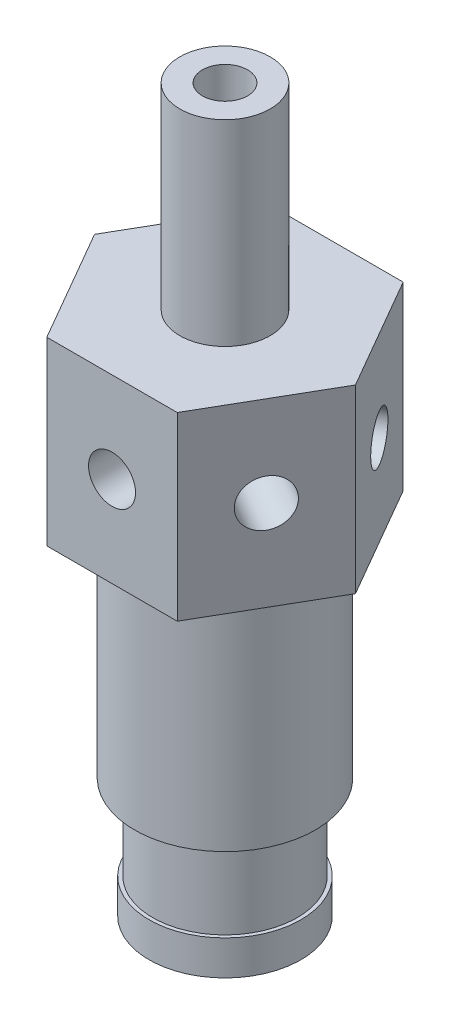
ISO-10303-21;
HEADER;
FILE_DESCRIPTION(('STEP AP214'),'2;1');
FILE_NAME('part.step','',(''),(''),'','','');
FILE_SCHEMA(('AUTOMOTIVE_DESIGN { 1 0 10303 214 1 1 1 1 }'));
ENDSEC;
DATA;
#1=APPLICATION_CONTEXT('core data for automotive mechanical design processes');
#2=APPLICATION_PROTOCOL_DEFINITION('international standard','automotive_design',2000,#1);
#3=PRODUCT_CONTEXT('',#1,'mechanical');
#4=PRODUCT('Part','Part','',(#3));
#5=PRODUCT_RELATED_PRODUCT_CATEGORY('part','',(#4));
#6=PRODUCT_DEFINITION_FORMATION('','',#4);
#7=PRODUCT_DEFINITION_CONTEXT('part definition',#1,'design');
#8=PRODUCT_DEFINITION('design','',#6,#7);
#9=PRODUCT_DEFINITION_SHAPE('','',#8);
#10=(LENGTH_UNIT() NAMED_UNIT(*) SI_UNIT(.MILLI.,.METRE.));
#11=(NAMED_UNIT(*) PLANE_ANGLE_UNIT() SI_UNIT($,.RADIAN.));
#12=(NAMED_UNIT(*) SI_UNIT($,.STERADIAN.) SOLID_ANGLE_UNIT());
#13=UNCERTAINTY_MEASURE_WITH_UNIT(LENGTH_MEASURE(1.E-05),#10,'distance_accuracy_value','');
#14=(GEOMETRIC_REPRESENTATION_CONTEXT(3) GLOBAL_UNCERTAINTY_ASSIGNED_CONTEXT((#13)) GLOBAL_UNIT_ASSIGNED_CONTEXT((#10,
#11,#12)) REPRESENTATION_CONTEXT('',''));
#15=CARTESIAN_POINT('',(0.,0.,0.));
#16=DIRECTION('',(0.,0.,1.));
#17=DIRECTION('',(1.,0.,0.));
#18=AXIS2_PLACEMENT_3D('',#15,#16,#17);
#19=CARTESIAN_POINT('',(-3.175,12.15,0.));
#20=DIRECTION('',(0.,1.,0.));
#21=DIRECTION('',(0.,0.,1.));
#22=AXIS2_PLACEMENT_3D('',#19,#20,#21);
#23=PLANE('',#22);
#24=CARTESIAN_POINT('',(0.,12.15,0.));
#25=DIRECTION('',(0.,-1.,0.));
#26=DIRECTION('',(0.,0.,-1.));
#27=AXIS2_PLACEMENT_3D('',#24,#25,#26);
#28=CIRCLE('',#27,3.175);
#29=CARTESIAN_POINT('',(0.,12.15,-3.175));
#30=VERTEX_POINT('',#29);
#31=EDGE_CURVE('E54',#30,#30,#28,.T.);
#32=ORIENTED_EDGE('',*,*,#31,.F.);
#33=EDGE_LOOP('',(#32));
#34=FACE_BOUND('',#33,.T.);
#35=DIRECTION('',(0.5,0.,-0.866025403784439));
#36=VECTOR('',#35,1.);
#37=CARTESIAN_POINT('',(2.64328832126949,12.15,3.3591903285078));
#38=LINE('',#37,#36);
#39=CARTESIAN_POINT('',(2.29135888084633,12.15,3.96875));
#40=VERTEX_POINT('',#39);
#41=CARTESIAN_POINT('',(4.58271776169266,12.15,0.));
#42=VERTEX_POINT('',#41);
#43=EDGE_CURVE('E302',#40,#42,#38,.T.);
#44=ORIENTED_EDGE('',*,*,#43,.F.);
#45=DIRECTION('',(1.,0.,0.));
#46=VECTOR('',#45,1.);
#47=CARTESIAN_POINT('',(-3.175,12.15,3.96875));
#48=LINE('',#47,#46);
#49=CARTESIAN_POINT('',(-2.29135888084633,12.15,3.96875));
#50=VERTEX_POINT('',#49);
#51=EDGE_CURVE('E305',#50,#40,#48,.T.);
#52=ORIENTED_EDGE('',*,*,#51,.F.);
#53=DIRECTION('',(0.5,0.,0.866025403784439));
#54=VECTOR('',#53,1.);
#55=CARTESIAN_POINT('',(-4.23078832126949,12.15,0.609559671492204));
#56=LINE('',#55,#54);
#57=CARTESIAN_POINT('',(-4.58271776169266,12.15,0.));
#58=VERTEX_POINT('',#57);
#59=EDGE_CURVE('E308',#58,#50,#56,.T.);
#60=ORIENTED_EDGE('',*,*,#59,.F.);
#61=DIRECTION('',(-0.5,0.,0.866025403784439));
#62=VECTOR('',#61,1.);
#63=CARTESIAN_POINT('',(-4.23078832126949,12.15,-0.609559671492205));
#64=LINE('',#63,#62);
#65=CARTESIAN_POINT('',(-2.29135888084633,12.15,-3.96875));
#66=VERTEX_POINT('',#65);
#67=EDGE_CURVE('E311',#66,#58,#64,.T.);
#68=ORIENTED_EDGE('',*,*,#67,.F.);
#69=DIRECTION('',(-1.,0.,0.));
#70=VECTOR('',#69,1.);
#71=CARTESIAN_POINT('',(-3.175,12.15,-3.96875));
#72=LINE('',#71,#70);
#73=CARTESIAN_POINT('',(2.29135888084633,12.15,-3.96875));
#74=VERTEX_POINT('',#73);
#75=EDGE_CURVE('E314',#74,#66,#72,.T.);
#76=ORIENTED_EDGE('',*,*,#75,.F.);
#77=DIRECTION('',(-0.5,0.,-0.866025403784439));
#78=VECTOR('',#77,1.);
#79=CARTESIAN_POINT('',(2.64328832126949,12.15,-3.3591903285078));
#80=LINE('',#79,#78);
#81=EDGE_CURVE('E317',#42,#74,#80,.T.);
#82=ORIENTED_EDGE('',*,*,#81,.F.);
#83=EDGE_LOOP('',(#44,#52,#60,#68,#76,#82));
#84=FACE_BOUND('',#83,.T.);
#85=ADVANCED_FACE('F45',(#34,#84),#23,.F.);
#86=CARTESIAN_POINT('',(-4.7625,18.5,0.));
#87=DIRECTION('',(0.,-1.,0.));
#88=DIRECTION('',(0.,0.,-1.));
#89=AXIS2_PLACEMENT_3D('',#86,#87,#88);
#90=PLANE('',#89);
#91=CARTESIAN_POINT('',(0.,18.5,0.));
#92=DIRECTION('',(0.,-1.,0.));
#93=DIRECTION('',(0.,0.,-1.));
#94=AXIS2_PLACEMENT_3D('',#91,#92,#93);
#95=CIRCLE('',#94,1.5875);
#96=CARTESIAN_POINT('',(0.,18.5,-1.5875));
#97=VERTEX_POINT('',#96);
#98=EDGE_CURVE('E252',#97,#97,#95,.T.);
#99=ORIENTED_EDGE('',*,*,#98,.T.);
#100=EDGE_LOOP('',(#99));
#101=FACE_BOUND('',#100,.T.);
#102=DIRECTION('',(0.5,0.,-0.866025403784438));
#103=VECTOR('',#102,1.);
#104=CARTESIAN_POINT('',(2.29135888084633,18.5,3.96875));
#105=LINE('',#104,#103);
#106=CARTESIAN_POINT('',(2.29135888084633,18.5,3.96875));
#107=VERTEX_POINT('',#106);
#108=CARTESIAN_POINT('',(4.58271776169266,18.5,0.));
#109=VERTEX_POINT('',#108);
#110=EDGE_CURVE('E358',#107,#109,#105,.T.);
#111=ORIENTED_EDGE('',*,*,#110,.T.);
#112=DIRECTION('',(-0.5,0.,-0.866025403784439));
#113=VECTOR('',#112,1.);
#114=CARTESIAN_POINT('',(4.58271776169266,18.5,0.));
#115=LINE('',#114,#113);
#116=CARTESIAN_POINT('',(2.29135888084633,18.5,-3.96875));
#117=VERTEX_POINT('',#116);
#118=EDGE_CURVE('E355',#109,#117,#115,.T.);
#119=ORIENTED_EDGE('',*,*,#118,.T.);
#120=DIRECTION('',(-1.,0.,0.));
#121=VECTOR('',#120,1.);
#122=CARTESIAN_POINT('',(2.29135888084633,18.5,-3.96875));
#123=LINE('',#122,#121);
#124=CARTESIAN_POINT('',(-2.29135888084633,18.5,-3.96875));
#125=VERTEX_POINT('',#124);
#126=EDGE_CURVE('E351',#117,#125,#123,.T.);
#127=ORIENTED_EDGE('',*,*,#126,.T.);
#128=DIRECTION('',(-0.5,0.,0.866025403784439));
#129=VECTOR('',#128,1.);
#130=CARTESIAN_POINT('',(-2.29135888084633,18.5,-3.96875));
#131=LINE('',#130,#129);
#132=CARTESIAN_POINT('',(-4.58271776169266,18.5,0.));
#133=VERTEX_POINT('',#132);
#134=EDGE_CURVE('E347',#125,#133,#131,.T.);
#135=ORIENTED_EDGE('',*,*,#134,.T.);
#136=DIRECTION('',(0.5,0.,0.866025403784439));
#137=VECTOR('',#136,1.);
#138=CARTESIAN_POINT('',(-4.58271776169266,18.5,0.));
#139=LINE('',#138,#137);
#140=CARTESIAN_POINT('',(-2.29135888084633,18.5,3.96875));
#141=VERTEX_POINT('',#140);
#142=EDGE_CURVE('E343',#133,#141,#139,.T.);
#143=ORIENTED_EDGE('',*,*,#142,.T.);
#144=DIRECTION('',(1.,0.,0.));
#145=VECTOR('',#144,1.);
#146=CARTESIAN_POINT('',(-2.29135888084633,18.5,3.96875));
#147=LINE('',#146,#145);
#148=EDGE_CURVE('E325',#141,#107,#147,.T.);
#149=ORIENTED_EDGE('',*,*,#148,.T.);
#150=EDGE_LOOP('',(#111,#119,#127,#135,#143,#149));
#151=FACE_BOUND('',#150,.T.);
#152=ADVANCED_FACE('F226',(#101,#151),#90,.F.);
#153=CARTESIAN_POINT('',(-3.175,4.254,0.));
#154=DIRECTION('',(0.,1.,0.));
#155=DIRECTION('',(0.,0.,1.));
#156=AXIS2_PLACEMENT_3D('',#153,#154,#155);
#157=PLANE('',#156);
#158=CARTESIAN_POINT('',(0.,4.254,0.));
#159=DIRECTION('',(0.,-1.,0.));
#160=DIRECTION('',(0.,0.,-1.));
#161=AXIS2_PLACEMENT_3D('',#158,#159,#160);
#162=CIRCLE('',#161,2.667);
#163=CARTESIAN_POINT('',(0.,4.254,-2.667));
#164=VERTEX_POINT('',#163);
#165=EDGE_CURVE('E298',#164,#164,#162,.T.);
#166=ORIENTED_EDGE('',*,*,#165,.F.);
#167=EDGE_LOOP('',(#166));
#168=FACE_BOUND('',#167,.T.);
#169=CARTESIAN_POINT('',(0.,4.254,0.));
#170=DIRECTION('',(0.,-1.,0.));
#171=DIRECTION('',(0.,0.,-1.));
#172=AXIS2_PLACEMENT_3D('',#169,#170,#171);
#173=CIRCLE('',#172,3.175);
#174=CARTESIAN_POINT('',(0.,4.254,-3.175));
#175=VERTEX_POINT('',#174);
#176=EDGE_CURVE('E12',#175,#175,#173,.T.);
#177=ORIENTED_EDGE('',*,*,#176,.T.);
#178=EDGE_LOOP('',(#177));
#179=FACE_BOUND('',#178,.T.);
#180=ADVANCED_FACE('F47',(#168,#179),#157,.F.);
#181=CARTESIAN_POINT('',(0.,0.,0.));
#182=DIRECTION('',(0.,-1.,0.));
#183=DIRECTION('',(0.,0.,-1.));
#184=AXIS2_PLACEMENT_3D('',#181,#182,#183);
#185=CYLINDRICAL_SURFACE('',#184,3.175);
#186=ORIENTED_EDGE('',*,*,#176,.F.);
#187=EDGE_LOOP('',(#186));
#188=FACE_BOUND('',#187,.T.);
#189=ORIENTED_EDGE('',*,*,#31,.T.);
#190=EDGE_LOOP('',(#189));
#191=FACE_BOUND('',#190,.T.);
#192=ADVANCED_FACE('F237',(#188,#191),#185,.T.);
#193=CARTESIAN_POINT('',(0.,0.,0.));
#194=DIRECTION('',(0.,-1.,0.));
#195=DIRECTION('',(0.,0.,-1.));
#196=AXIS2_PLACEMENT_3D('',#193,#194,#195);
#197=CYLINDRICAL_SURFACE('',#196,1.5875);
#198=ORIENTED_EDGE('',*,*,#98,.F.);
#199=EDGE_LOOP('',(#198));
#200=FACE_BOUND('',#199,.T.);
#201=CARTESIAN_POINT('',(0.,25.4,0.));
#202=DIRECTION('',(0.,-1.,0.));
#203=DIRECTION('',(0.,0.,-1.));
#204=AXIS2_PLACEMENT_3D('',#201,#202,#203);
#205=CIRCLE('',#204,1.5875);
#206=CARTESIAN_POINT('',(0.,25.4,-1.5875));
#207=VERTEX_POINT('',#206);
#208=EDGE_CURVE('E256',#207,#207,#205,.T.);
#209=ORIENTED_EDGE('',*,*,#208,.T.);
#210=EDGE_LOOP('',(#209));
#211=FACE_BOUND('',#210,.T.);
#212=ADVANCED_FACE('F239',(#200,#211),#197,.T.);
#213=CARTESIAN_POINT('',(-1.5875,25.4,0.));
#214=DIRECTION('',(0.,-1.,0.));
#215=DIRECTION('',(0.,0.,-1.));
#216=AXIS2_PLACEMENT_3D('',#213,#214,#215);
#217=PLANE('',#216);
#218=ORIENTED_EDGE('',*,*,#208,.F.);
#219=EDGE_LOOP('',(#218));
#220=FACE_BOUND('',#219,.T.);
#221=CARTESIAN_POINT('',(0.,25.4,0.));
#222=DIRECTION('',(0.,-1.,0.));
#223=DIRECTION('',(0.,0.,-1.));
#224=AXIS2_PLACEMENT_3D('',#221,#222,#223);
#225=CIRCLE('',#224,0.79375);
#226=CARTESIAN_POINT('',(0.,25.4,-0.79375));
#227=VERTEX_POINT('',#226);
#228=EDGE_CURVE('E262',#227,#227,#225,.T.);
#229=ORIENTED_EDGE('',*,*,#228,.T.);
#230=EDGE_LOOP('',(#229));
#231=FACE_BOUND('',#230,.T.);
#232=ADVANCED_FACE('F245',(#220,#231),#217,.F.);
#233=CARTESIAN_POINT('',(0.,0.,0.));
#234=DIRECTION('',(0.,-1.,0.));
#235=DIRECTION('',(0.,0.,-1.));
#236=AXIS2_PLACEMENT_3D('',#233,#234,#235);
#237=CYLINDRICAL_SURFACE('',#236,0.793749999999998);
#238=ORIENTED_EDGE('',*,*,#228,.F.);
#239=EDGE_LOOP('',(#238));
#240=FACE_BOUND('',#239,.T.);
#241=CARTESIAN_POINT('',(0.,0.,0.));
#242=DIRECTION('',(0.,-1.,0.));
#243=DIRECTION('',(0.,0.,-1.));
#244=AXIS2_PLACEMENT_3D('',#241,#242,#243);
#245=CIRCLE('',#244,0.793749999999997);
#246=CARTESIAN_POINT('',(0.,0.,-0.793749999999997));
#247=VERTEX_POINT('',#246);
#248=EDGE_CURVE('E266',#247,#247,#245,.T.);
#249=ORIENTED_EDGE('',*,*,#248,.T.);
#250=EDGE_LOOP('',(#249));
#251=FACE_BOUND('',#250,.T.);
#252=ADVANCED_FACE('F471',(#240,#251),#237,.F.);
#253=CARTESIAN_POINT('',(-0.793749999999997,0.,0.));
#254=DIRECTION('',(0.,1.,0.));
#255=DIRECTION('',(0.,0.,1.));
#256=AXIS2_PLACEMENT_3D('',#253,#254,#255);
#257=PLANE('',#256);
#258=ORIENTED_EDGE('',*,*,#248,.F.);
#259=EDGE_LOOP('',(#258));
#260=FACE_BOUND('',#259,.T.);
#261=CARTESIAN_POINT('',(0.,0.,0.));
#262=DIRECTION('',(0.,-1.,0.));
#263=DIRECTION('',(0.,0.,-1.));
#264=AXIS2_PLACEMENT_3D('',#261,#262,#263);
#265=CIRCLE('',#264,1.5875);
#266=CARTESIAN_POINT('',(0.,0.,-1.5875));
#267=VERTEX_POINT('',#266);
#268=EDGE_CURVE('E270',#267,#267,#265,.T.);
#269=ORIENTED_EDGE('',*,*,#268,.T.);
#270=EDGE_LOOP('',(#269));
#271=FACE_BOUND('',#270,.T.);
#272=ADVANCED_FACE('F467',(#260,#271),#257,.F.);
#273=CARTESIAN_POINT('',(0.,0.,0.));
#274=DIRECTION('',(0.,-1.,0.));
#275=DIRECTION('',(0.,0.,-1.));
#276=AXIS2_PLACEMENT_3D('',#273,#274,#275);
#277=CYLINDRICAL_SURFACE('',#276,1.5875);
#278=ORIENTED_EDGE('',*,*,#268,.F.);
#279=EDGE_LOOP('',(#278));
#280=FACE_BOUND('',#279,.T.);
#281=CARTESIAN_POINT('',(0.,0.0507999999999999,0.));
#282=DIRECTION('',(0.,-1.,0.));
#283=DIRECTION('',(0.,0.,-1.));
#284=AXIS2_PLACEMENT_3D('',#281,#282,#283);
#285=CIRCLE('',#284,1.5875);
#286=CARTESIAN_POINT('',(0.,0.0507999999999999,-1.5875));
#287=VERTEX_POINT('',#286);
#288=EDGE_CURVE('E274',#287,#287,#285,.T.);
#289=ORIENTED_EDGE('',*,*,#288,.T.);
#290=EDGE_LOOP('',(#289));
#291=FACE_BOUND('',#290,.T.);
#292=ADVANCED_FACE('F463',(#280,#291),#277,.T.);
#293=CARTESIAN_POINT('',(-1.5875,0.0507999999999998,0.));
#294=DIRECTION('',(0.,1.,0.));
#295=DIRECTION('',(0.,0.,1.));
#296=AXIS2_PLACEMENT_3D('',#293,#294,#295);
#297=PLANE('',#296);
#298=ORIENTED_EDGE('',*,*,#288,.F.);
#299=EDGE_LOOP('',(#298));
#300=FACE_BOUND('',#299,.T.);
#301=CARTESIAN_POINT('',(0.,0.0507999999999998,0.));
#302=DIRECTION('',(0.,-1.,0.));
#303=DIRECTION('',(0.,0.,-1.));
#304=AXIS2_PLACEMENT_3D('',#301,#302,#303);
#305=CIRCLE('',#304,2.667);
#306=CARTESIAN_POINT('',(0.,0.0507999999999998,-2.667));
#307=VERTEX_POINT('',#306);
#308=EDGE_CURVE('E278',#307,#307,#305,.T.);
#309=ORIENTED_EDGE('',*,*,#308,.T.);
#310=EDGE_LOOP('',(#309));
#311=FACE_BOUND('',#310,.T.);
#312=ADVANCED_FACE('F459',(#300,#311),#297,.F.);
#313=CARTESIAN_POINT('',(0.,0.,0.));
#314=DIRECTION('',(0.,-1.,0.));
#315=DIRECTION('',(0.,0.,-1.));
#316=AXIS2_PLACEMENT_3D('',#313,#314,#315);
#317=CYLINDRICAL_SURFACE('',#316,2.667);
#318=ORIENTED_EDGE('',*,*,#308,.F.);
#319=EDGE_LOOP('',(#318));
#320=FACE_BOUND('',#319,.T.);
#321=CARTESIAN_POINT('',(0.,1.27,0.));
#322=DIRECTION('',(0.,-1.,0.));
#323=DIRECTION('',(0.,0.,-1.));
#324=AXIS2_PLACEMENT_3D('',#321,#322,#323);
#325=CIRCLE('',#324,2.667);
#326=CARTESIAN_POINT('',(0.,1.27,-2.667));
#327=VERTEX_POINT('',#326);
#328=EDGE_CURVE('E282',#327,#327,#325,.T.);
#329=ORIENTED_EDGE('',*,*,#328,.T.);
#330=EDGE_LOOP('',(#329));
#331=FACE_BOUND('',#330,.T.);
#332=ADVANCED_FACE('F455',(#320,#331),#317,.T.);
#333=CARTESIAN_POINT('',(-2.54,1.27,0.));
#334=DIRECTION('',(0.,-1.,0.));
#335=DIRECTION('',(0.,0.,-1.));
#336=AXIS2_PLACEMENT_3D('',#333,#334,#335);
#337=PLANE('',#336);
#338=ORIENTED_EDGE('',*,*,#328,.F.);
#339=EDGE_LOOP('',(#338));
#340=FACE_BOUND('',#339,.T.);
#341=CARTESIAN_POINT('',(0.,1.27,0.));
#342=DIRECTION('',(0.,-1.,0.));
#343=DIRECTION('',(0.,0.,-1.));
#344=AXIS2_PLACEMENT_3D('',#341,#342,#343);
#345=CIRCLE('',#344,2.54);
#346=CARTESIAN_POINT('',(0.,1.27,-2.54));
#347=VERTEX_POINT('',#346);
#348=EDGE_CURVE('E286',#347,#347,#345,.T.);
#349=ORIENTED_EDGE('',*,*,#348,.T.);
#350=EDGE_LOOP('',(#349));
#351=FACE_BOUND('',#350,.T.);
#352=ADVANCED_FACE('F451',(#340,#351),#337,.F.);
#353=CARTESIAN_POINT('',(0.,0.,0.));
#354=DIRECTION('',(0.,-1.,0.));
#355=DIRECTION('',(0.,0.,-1.));
#356=AXIS2_PLACEMENT_3D('',#353,#354,#355);
#357=CYLINDRICAL_SURFACE('',#356,2.54);
#358=ORIENTED_EDGE('',*,*,#348,.F.);
#359=EDGE_LOOP('',(#358));
#360=FACE_BOUND('',#359,.T.);
#361=CARTESIAN_POINT('',(0.,4.,0.));
#362=DIRECTION('',(0.,-1.,0.));
#363=DIRECTION('',(0.,0.,-1.));
#364=AXIS2_PLACEMENT_3D('',#361,#362,#363);
#365=CIRCLE('',#364,2.54);
#366=CARTESIAN_POINT('',(0.,4.,-2.54));
#367=VERTEX_POINT('',#366);
#368=EDGE_CURVE('E290',#367,#367,#365,.T.);
#369=ORIENTED_EDGE('',*,*,#368,.T.);
#370=EDGE_LOOP('',(#369));
#371=FACE_BOUND('',#370,.T.);
#372=ADVANCED_FACE('F447',(#360,#371),#357,.T.);
#373=CARTESIAN_POINT('',(-2.54,4.,0.));
#374=DIRECTION('',(0.,1.,0.));
#375=DIRECTION('',(0.,0.,1.));
#376=AXIS2_PLACEMENT_3D('',#373,#374,#375);
#377=PLANE('',#376);
#378=ORIENTED_EDGE('',*,*,#368,.F.);
#379=EDGE_LOOP('',(#378));
#380=FACE_BOUND('',#379,.T.);
#381=CARTESIAN_POINT('',(0.,4.,0.));
#382=DIRECTION('',(0.,-1.,0.));
#383=DIRECTION('',(0.,0.,-1.));
#384=AXIS2_PLACEMENT_3D('',#381,#382,#383);
#385=CIRCLE('',#384,2.667);
#386=CARTESIAN_POINT('',(0.,4.,-2.667));
#387=VERTEX_POINT('',#386);
#388=EDGE_CURVE('E294',#387,#387,#385,.T.);
#389=ORIENTED_EDGE('',*,*,#388,.T.);
#390=EDGE_LOOP('',(#389));
#391=FACE_BOUND('',#390,.T.);
#392=ADVANCED_FACE('F443',(#380,#391),#377,.F.);
#393=CARTESIAN_POINT('',(0.,0.,0.));
#394=DIRECTION('',(0.,-1.,0.));
#395=DIRECTION('',(0.,0.,-1.));
#396=AXIS2_PLACEMENT_3D('',#393,#394,#395);
#397=CYLINDRICAL_SURFACE('',#396,2.667);
#398=ORIENTED_EDGE('',*,*,#388,.F.);
#399=EDGE_LOOP('',(#398));
#400=FACE_BOUND('',#399,.T.);
#401=ORIENTED_EDGE('',*,*,#165,.T.);
#402=EDGE_LOOP('',(#401));
#403=FACE_BOUND('',#402,.T.);
#404=ADVANCED_FACE('F439',(#400,#403),#397,.T.);
#405=CARTESIAN_POINT('',(2.29135888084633,0.,3.96875));
#406=DIRECTION('',(0.866025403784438,0.,0.5));
#407=DIRECTION('',(0.5,0.,-0.866025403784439));
#408=AXIS2_PLACEMENT_3D('',#405,#406,#407);
#409=PLANE('',#408);
#410=CARTESIAN_POINT('',(3.43703832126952,15.325,1.98437499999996));
#411=DIRECTION('',(0.866025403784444,0.,0.49999999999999));
#412=DIRECTION('',(0.49999999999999,0.,-0.866025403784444));
#413=AXIS2_PLACEMENT_3D('',#410,#411,#412);
#414=CIRCLE('',#413,0.8255);
#415=CARTESIAN_POINT('',(3.84978832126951,15.325,1.2694710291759));
#416=VERTEX_POINT('',#415);
#417=EDGE_CURVE('E140',#416,#416,#414,.T.);
#418=ORIENTED_EDGE('',*,*,#417,.F.);
#419=EDGE_LOOP('',(#418));
#420=FACE_BOUND('',#419,.T.);
#421=ORIENTED_EDGE('',*,*,#43,.T.);
#422=DIRECTION('',(0.,1.,0.));
#423=VECTOR('',#422,1.);
#424=CARTESIAN_POINT('',(4.58271776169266,0.,0.));
#425=LINE('',#424,#423);
#426=EDGE_CURVE('E321',#42,#109,#425,.T.);
#427=ORIENTED_EDGE('',*,*,#426,.T.);
#428=ORIENTED_EDGE('',*,*,#110,.F.);
#429=DIRECTION('',(0.,1.,0.));
#430=VECTOR('',#429,1.);
#431=CARTESIAN_POINT('',(2.29135888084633,0.,3.96875));
#432=LINE('',#431,#430);
#433=EDGE_CURVE('E320',#40,#107,#432,.T.);
#434=ORIENTED_EDGE('',*,*,#433,.F.);
#435=EDGE_LOOP('',(#421,#427,#428,#434));
#436=FACE_BOUND('',#435,.T.);
#437=ADVANCED_FACE('F416',(#420,#436),#409,.T.);
#438=CARTESIAN_POINT('',(-2.29135888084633,0.,3.96875));
#439=DIRECTION('',(0.,0.,1.));
#440=DIRECTION('',(1.,0.,0.));
#441=AXIS2_PLACEMENT_3D('',#438,#439,#440);
#442=PLANE('',#441);
#443=CARTESIAN_POINT('',(0.,15.325,3.96875));
#444=DIRECTION('',(0.,0.,1.));
#445=DIRECTION('',(1.,0.,0.));
#446=AXIS2_PLACEMENT_3D('',#443,#444,#445);
#447=CIRCLE('',#446,0.8255);
#448=CARTESIAN_POINT('',(0.825500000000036,15.325,3.96874999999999));
#449=VERTEX_POINT('',#448);
#450=EDGE_CURVE('E157',#449,#449,#447,.T.);
#451=ORIENTED_EDGE('',*,*,#450,.F.);
#452=EDGE_LOOP('',(#451));
#453=FACE_BOUND('',#452,.T.);
#454=ORIENTED_EDGE('',*,*,#51,.T.);
#455=ORIENTED_EDGE('',*,*,#433,.T.);
#456=ORIENTED_EDGE('',*,*,#148,.F.);
#457=DIRECTION('',(0.,1.,0.));
#458=VECTOR('',#457,1.);
#459=CARTESIAN_POINT('',(-2.29135888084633,0.,3.96875));
#460=LINE('',#459,#458);
#461=EDGE_CURVE('E335',#50,#141,#460,.T.);
#462=ORIENTED_EDGE('',*,*,#461,.F.);
#463=EDGE_LOOP('',(#454,#455,#456,#462));
#464=FACE_BOUND('',#463,.T.);
#465=ADVANCED_FACE('F401',(#453,#464),#442,.T.);
#466=CARTESIAN_POINT('',(-4.58271776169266,0.,0.));
#467=DIRECTION('',(-0.866025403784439,0.,0.5));
#468=DIRECTION('',(0.5,0.,0.866025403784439));
#469=AXIS2_PLACEMENT_3D('',#466,#467,#468);
#470=PLANE('',#469);
#471=CARTESIAN_POINT('',(-3.43703832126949,15.325,1.984375));
#472=DIRECTION('',(-0.866025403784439,0.,0.5));
#473=DIRECTION('',(0.5,0.,0.866025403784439));
#474=AXIS2_PLACEMENT_3D('',#471,#472,#473);
#475=CIRCLE('',#474,0.8255);
#476=CARTESIAN_POINT('',(-3.02428832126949,15.325,2.69927897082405));
#477=VERTEX_POINT('',#476);
#478=EDGE_CURVE('E152',#477,#477,#475,.T.);
#479=ORIENTED_EDGE('',*,*,#478,.F.);
#480=EDGE_LOOP('',(#479));
#481=FACE_BOUND('',#480,.T.);
#482=ORIENTED_EDGE('',*,*,#59,.T.);
#483=ORIENTED_EDGE('',*,*,#461,.T.);
#484=ORIENTED_EDGE('',*,*,#142,.F.);
#485=DIRECTION('',(0.,1.,0.));
#486=VECTOR('',#485,1.);
#487=CARTESIAN_POINT('',(-4.58271776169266,0.,0.));
#488=LINE('',#487,#486);
#489=EDGE_CURVE('E332',#58,#133,#488,.T.);
#490=ORIENTED_EDGE('',*,*,#489,.F.);
#491=EDGE_LOOP('',(#482,#483,#484,#490));
#492=FACE_BOUND('',#491,.T.);
#493=ADVANCED_FACE('F397',(#481,#492),#470,.T.);
#494=CARTESIAN_POINT('',(-2.29135888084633,0.,-3.96875));
#495=DIRECTION('',(-0.866025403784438,0.,-0.5));
#496=DIRECTION('',(-0.5,0.,0.866025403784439));
#497=AXIS2_PLACEMENT_3D('',#494,#495,#496);
#498=PLANE('',#497);
#499=CARTESIAN_POINT('',(-3.4370383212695,15.325,-1.98437499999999));
#500=DIRECTION('',(-0.866025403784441,0.,-0.499999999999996));
#501=DIRECTION('',(-0.499999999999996,0.,0.866025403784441));
#502=AXIS2_PLACEMENT_3D('',#499,#500,#501);
#503=CIRCLE('',#502,0.8255);
#504=CARTESIAN_POINT('',(-3.8497883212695,15.325,-1.26947102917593));
#505=VERTEX_POINT('',#504);
#506=EDGE_CURVE('E211',#505,#505,#503,.T.);
#507=ORIENTED_EDGE('',*,*,#506,.F.);
#508=EDGE_LOOP('',(#507));
#509=FACE_BOUND('',#508,.T.);
#510=ORIENTED_EDGE('',*,*,#67,.T.);
#511=ORIENTED_EDGE('',*,*,#489,.T.);
#512=ORIENTED_EDGE('',*,*,#134,.F.);
#513=DIRECTION('',(0.,1.,0.));
#514=VECTOR('',#513,1.);
#515=CARTESIAN_POINT('',(-2.29135888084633,0.,-3.96875));
#516=LINE('',#515,#514);
#517=EDGE_CURVE('E329',#66,#125,#516,.T.);
#518=ORIENTED_EDGE('',*,*,#517,.F.);
#519=EDGE_LOOP('',(#510,#511,#512,#518));
#520=FACE_BOUND('',#519,.T.);
#521=ADVANCED_FACE('F400',(#509,#520),#498,.T.);
#522=CARTESIAN_POINT('',(2.29135888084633,0.,-3.96875));
#523=DIRECTION('',(0.,0.,-1.));
#524=DIRECTION('',(-1.,0.,0.));
#525=AXIS2_PLACEMENT_3D('',#522,#523,#524);
#526=PLANE('',#525);
#527=CARTESIAN_POINT('',(0.,15.325,-3.96875));
#528=DIRECTION('',(0.,0.,-1.));
#529=DIRECTION('',(-1.,0.,0.));
#530=AXIS2_PLACEMENT_3D('',#527,#528,#529);
#531=CIRCLE('',#530,0.8255);
#532=CARTESIAN_POINT('',(-0.825500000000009,15.325,-3.96875));
#533=VERTEX_POINT('',#532);
#534=EDGE_CURVE('E381',#533,#533,#531,.T.);
#535=ORIENTED_EDGE('',*,*,#534,.F.);
#536=EDGE_LOOP('',(#535));
#537=FACE_BOUND('',#536,.T.);
#538=ORIENTED_EDGE('',*,*,#75,.T.);
#539=ORIENTED_EDGE('',*,*,#517,.T.);
#540=ORIENTED_EDGE('',*,*,#126,.F.);
#541=DIRECTION('',(0.,1.,0.));
#542=VECTOR('',#541,1.);
#543=CARTESIAN_POINT('',(2.29135888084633,0.,-3.96875));
#544=LINE('',#543,#542);
#545=EDGE_CURVE('E324',#74,#117,#544,.T.);
#546=ORIENTED_EDGE('',*,*,#545,.F.);
#547=EDGE_LOOP('',(#538,#539,#540,#546));
#548=FACE_BOUND('',#547,.T.);
#549=ADVANCED_FACE('F423',(#537,#548),#526,.T.);
#550=CARTESIAN_POINT('',(4.58271776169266,0.,0.));
#551=DIRECTION('',(0.866025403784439,0.,-0.5));
#552=DIRECTION('',(-0.5,0.,-0.866025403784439));
#553=AXIS2_PLACEMENT_3D('',#550,#551,#552);
#554=PLANE('',#553);
#555=CARTESIAN_POINT('',(3.43703832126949,15.325,-1.984375));
#556=DIRECTION('',(0.866025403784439,0.,-0.5));
#557=DIRECTION('',(-0.5,0.,-0.866025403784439));
#558=AXIS2_PLACEMENT_3D('',#555,#556,#557);
#559=CIRCLE('',#558,0.8255);
#560=CARTESIAN_POINT('',(3.02428832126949,15.325,-2.69927897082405));
#561=VERTEX_POINT('',#560);
#562=EDGE_CURVE('E365',#561,#561,#559,.T.);
#563=ORIENTED_EDGE('',*,*,#562,.F.);
#564=EDGE_LOOP('',(#563));
#565=FACE_BOUND('',#564,.T.);
#566=ORIENTED_EDGE('',*,*,#81,.T.);
#567=ORIENTED_EDGE('',*,*,#545,.T.);
#568=ORIENTED_EDGE('',*,*,#118,.F.);
#569=ORIENTED_EDGE('',*,*,#426,.F.);
#570=EDGE_LOOP('',(#566,#567,#568,#569));
#571=FACE_BOUND('',#570,.T.);
#572=ADVANCED_FACE('F425',(#565,#571),#554,.T.);
#573=CARTESIAN_POINT('',(-5.15674049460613,15.325,2.97724551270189));
#574=DIRECTION('',(0.866025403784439,0.,-0.5));
#575=DIRECTION('',(-0.5,0.,-0.866025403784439));
#576=AXIS2_PLACEMENT_3D('',#573,#574,#575);
#577=CYLINDRICAL_SURFACE('',#576,0.8255);
#578=ORIENTED_EDGE('',*,*,#562,.T.);
#579=EDGE_LOOP('',(#578));
#580=FACE_BOUND('',#579,.T.);
#581=CARTESIAN_POINT('',(0.76157086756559,15.325,-1.39289843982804));
#582=CARTESIAN_POINT('',(0.761576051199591,15.3677412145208,-1.39289776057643));
#583=CARTESIAN_POINT('',(0.765018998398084,15.410530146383,-1.39103021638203));
#584=CARTESIAN_POINT('',(0.778436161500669,15.4947724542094,-1.38356365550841));
#585=CARTESIAN_POINT('',(0.788422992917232,15.5362230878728,-1.37795743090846));
#586=CARTESIAN_POINT('',(0.813901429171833,15.6164081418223,-1.36306089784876));
#587=CARTESIAN_POINT('',(0.829361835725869,15.6551564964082,-1.35379143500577));
#588=CARTESIAN_POINT('',(0.864635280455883,15.7294484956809,-1.33153885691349));
#589=CARTESIAN_POINT('',(0.884448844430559,15.7649917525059,-1.31855529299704));
#590=CARTESIAN_POINT('',(0.929207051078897,15.8353772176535,-1.28745363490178));
#591=CARTESIAN_POINT('',(0.954452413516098,15.8698710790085,-1.26897964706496));
#592=CARTESIAN_POINT('',(1.00738547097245,15.9338432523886,-1.22738112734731));
#593=CARTESIAN_POINT('',(1.03507446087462,15.9633188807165,-1.20425412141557));
#594=CARTESIAN_POINT('',(1.09369528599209,16.0185690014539,-1.15137149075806));
#595=CARTESIAN_POINT('',(1.12471513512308,16.043905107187,-1.12125076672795));
#596=CARTESIAN_POINT('',(1.18642247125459,16.0870596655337,-1.05573521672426));
#597=CARTESIAN_POINT('',(1.21711017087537,16.1048832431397,-1.02034400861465));
#598=CARTESIAN_POINT('',(1.27426683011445,16.1310939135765,-0.947822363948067));
#599=CARTESIAN_POINT('',(1.30087919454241,16.140094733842,-0.911028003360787));
#600=CARTESIAN_POINT('',(1.3512292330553,16.1504356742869,-0.834522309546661));
#601=CARTESIAN_POINT('',(1.37496880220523,16.1517808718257,-0.794812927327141));
#602=CARTESIAN_POINT('',(1.41663137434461,16.1469858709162,-0.717672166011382));
#603=CARTESIAN_POINT('',(1.43489120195,16.1415365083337,-0.680376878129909));
#604=CARTESIAN_POINT('',(1.46799185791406,16.1245575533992,-0.605661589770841));
#605=CARTESIAN_POINT('',(1.48283242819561,16.1130275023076,-0.568241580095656));
#606=CARTESIAN_POINT('',(1.50923552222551,16.0841661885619,-0.493904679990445));
#607=CARTESIAN_POINT('',(1.52075356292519,16.0667624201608,-0.457000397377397));
#608=CARTESIAN_POINT('',(1.5405107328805,16.0267618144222,-0.385190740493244));
#609=CARTESIAN_POINT('',(1.54874872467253,16.0041631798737,-0.350286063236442));
#610=CARTESIAN_POINT('',(1.56306181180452,15.9518265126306,-0.280008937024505));
#611=CARTESIAN_POINT('',(1.56883817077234,15.9216004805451,-0.244938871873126));
#612=CARTESIAN_POINT('',(1.57768215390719,15.8561604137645,-0.179366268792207));
#613=CARTESIAN_POINT('',(1.58074740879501,15.8209420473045,-0.148867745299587));
#614=CARTESIAN_POINT('',(1.58513435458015,15.7434020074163,-0.0915938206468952));
#615=CARTESIAN_POINT('',(1.58631302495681,15.7007500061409,-0.0652505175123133));
#616=CARTESIAN_POINT('',(1.5875215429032,15.6113501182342,-0.0207676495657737));
#617=CARTESIAN_POINT('',(1.58755266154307,15.5646068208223,-0.00261903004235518));
#618=CARTESIAN_POINT('',(1.587382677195,15.4722934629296,0.0228997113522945));
#619=CARTESIAN_POINT('',(1.58720012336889,15.4269334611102,0.0310218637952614));
#620=CARTESIAN_POINT('',(1.58704274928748,15.3355129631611,0.0383119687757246));
#621=CARTESIAN_POINT('',(1.58706775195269,15.2894530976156,0.0374875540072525));
#622=CARTESIAN_POINT('',(1.58726443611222,15.2039991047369,0.0276427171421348));
#623=CARTESIAN_POINT('',(1.58741770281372,15.1644817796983,0.0196426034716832));
#624=CARTESIAN_POINT('',(1.58753652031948,15.087246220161,-0.00259322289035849));
#625=CARTESIAN_POINT('',(1.58750200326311,15.0495286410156,-0.0168311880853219));
#626=CARTESIAN_POINT('',(1.58676218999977,14.9749985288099,-0.0515227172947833));
#627=CARTESIAN_POINT('',(1.58602649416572,14.9383049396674,-0.0722292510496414));
#628=CARTESIAN_POINT('',(1.58323048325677,14.8682926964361,-0.118650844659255));
#629=CARTESIAN_POINT('',(1.58116948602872,14.8349757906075,-0.14436847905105));
#630=CARTESIAN_POINT('',(1.57468553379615,14.7678304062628,-0.203796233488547));
#631=CARTESIAN_POINT('',(1.5699749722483,14.7345702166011,-0.238119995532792));
#632=CARTESIAN_POINT('',(1.55718986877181,14.6737074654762,-0.310938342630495));
#633=CARTESIAN_POINT('',(1.54911388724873,14.6461073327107,-0.349434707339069));
#634=CARTESIAN_POINT('',(1.52853308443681,14.5964913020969,-0.430767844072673));
#635=CARTESIAN_POINT('',(1.51588295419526,14.574705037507,-0.473709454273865));
#636=CARTESIAN_POINT('',(1.48573932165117,14.5389873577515,-0.561128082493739));
#637=CARTESIAN_POINT('',(1.46825042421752,14.525048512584,-0.605603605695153));
#638=CARTESIAN_POINT('',(1.43037843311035,14.5067094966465,-0.690003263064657));
#639=CARTESIAN_POINT('',(1.41043555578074,14.5015207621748,-0.729953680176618));
#640=CARTESIAN_POINT('',(1.3670908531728,14.4984520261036,-0.808217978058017));
#641=CARTESIAN_POINT('',(1.34369045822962,14.5005690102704,-0.846532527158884));
#642=CARTESIAN_POINT('',(1.29614813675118,14.5115566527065,-0.91752176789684));
#643=CARTESIAN_POINT('',(1.27219275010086,14.5199100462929,-0.950403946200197));
#644=CARTESIAN_POINT('',(1.22292636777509,14.5423983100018,-1.01301286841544));
#645=CARTESIAN_POINT('',(1.19761519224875,14.5565339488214,-1.04273919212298));
#646=CARTESIAN_POINT('',(1.14554934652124,14.5907541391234,-1.09973772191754));
#647=CARTESIAN_POINT('',(1.11877746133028,14.6110542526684,-1.12686397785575));
#648=CARTESIAN_POINT('',(1.06581889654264,14.6567613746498,-1.17708128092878));
#649=CARTESIAN_POINT('',(1.03963248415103,14.6821706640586,-1.20017051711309));
#650=CARTESIAN_POINT('',(0.986182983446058,14.7404902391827,-1.24456031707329));
#651=CARTESIAN_POINT('',(0.959100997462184,14.7739106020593,-1.2654103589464));
#652=CARTESIAN_POINT('',(0.908350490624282,14.8456953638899,-1.30232209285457));
#653=CARTESIAN_POINT('',(0.884685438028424,14.8840647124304,-1.31837893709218));
#654=CARTESIAN_POINT('',(0.84141945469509,14.9668477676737,-1.34642654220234));
#655=CARTESIAN_POINT('',(0.822046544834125,15.0114545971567,-1.35820429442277));
#656=CARTESIAN_POINT('',(0.790710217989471,15.1041130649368,-1.37668886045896));
#657=CARTESIAN_POINT('',(0.778722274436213,15.1521527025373,-1.38341247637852));
#658=CARTESIAN_POINT('',(0.767980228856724,15.2214829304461,-1.3893785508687));
#659=CARTESIAN_POINT('',(0.765584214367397,15.2420864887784,-1.3906977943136));
#660=CARTESIAN_POINT('',(0.762378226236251,15.2834562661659,-1.39245793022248));
#661=CARTESIAN_POINT('',(0.761568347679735,15.304222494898,-1.39289877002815));
#662=CARTESIAN_POINT('',(0.76157086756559,15.325,-1.39289843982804));
#663=B_SPLINE_CURVE_WITH_KNOTS('',3,(#581,#582,#583,#584,#585,#586,#587,#588,#589,#590,#591,
#592,#593,#594,#595,#596,#597,#598,#599,#600,#601,#602,#603,#604,#605,#606,#607,#608,#609,#610,
#611,#612,#613,#614,#615,#616,#617,#618,#619,#620,#621,#622,#623,#624,#625,#626,#627,#628,#629,
#630,#631,#632,#633,#634,#635,#636,#637,#638,#639,#640,#641,#642,#643,#644,#645,#646,#647,#648,
#649,#650,#651,#652,#653,#654,#655,#656,#657,#658,#659,#660,#661,#662),.UNSPECIFIED.,.T.,.F.,(4,
2,2,2,2,2,2,2,2,2,2,2,2,2,2,2,2,2,2,2,2,2,2,2,2,2,2,2,2,2,2,2,2,2,2,2,2,2,2,2,4),(0.,
0.128135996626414,0.256519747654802,0.384183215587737,0.511862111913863,0.650984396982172,
0.790180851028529,0.939731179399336,1.08917931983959,1.22728042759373,1.36528993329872,
1.49034381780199,1.61540713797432,1.74207443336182,1.86878561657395,2.00817013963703,
2.14767635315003,2.29732866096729,2.44681520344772,2.58423059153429,2.72152875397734,
2.84194370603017,2.96240217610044,3.08833259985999,3.21432789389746,3.35777423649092,
3.50128200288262,3.64981969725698,3.79821651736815,3.93233887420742,4.06640590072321,
4.19044006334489,4.31449072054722,4.44350913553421,4.57258527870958,4.71537228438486,
4.8583032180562,5.00760163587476,5.15640149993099,5.21868767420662,5.28097758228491),.UNSPECIFIED.);
#664=CARTESIAN_POINT('',(0.793749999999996,15.5517403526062,-1.3748153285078));
#665=VERTEX_POINT('',#664);
#666=CARTESIAN_POINT('',(1.5875,15.5517403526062,0.));
#667=VERTEX_POINT('',#666);
#668=EDGE_CURVE('E138',#665,#667,#663,.T.);
#669=ORIENTED_EDGE('',*,*,#668,.F.);
#670=CARTESIAN_POINT('',(0.,15.325,0.));
#671=DIRECTION('',(0.866025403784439,0.,0.499999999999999));
#672=DIRECTION('',(0.499999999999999,0.,-0.866025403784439));
#673=AXIS2_PLACEMENT_3D('',#670,#671,#672);
#674=ELLIPSE('',#673,1.651,0.8255);
#675=CARTESIAN_POINT('',(0.793749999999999,15.0982596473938,-1.3748153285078));
#676=VERTEX_POINT('',#675);
#677=EDGE_CURVE('E369',#665,#676,#674,.F.);
#678=ORIENTED_EDGE('',*,*,#677,.T.);
#679=CARTESIAN_POINT('',(1.5875,15.0982596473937,0.));
#680=VERTEX_POINT('',#679);
#681=EDGE_CURVE('E363',#680,#676,#663,.T.);
#682=ORIENTED_EDGE('',*,*,#681,.F.);
#683=CARTESIAN_POINT('',(0.,15.325,0.));
#684=DIRECTION('',(0.,0.,-1.));
#685=DIRECTION('',(1.,0.,0.));
#686=AXIS2_PLACEMENT_3D('',#683,#684,#685);
#687=ELLIPSE('',#686,1.65100000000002,0.8255);
#688=EDGE_CURVE('E373',#680,#667,#687,.F.);
#689=ORIENTED_EDGE('',*,*,#688,.T.);
#690=EDGE_LOOP('',(#669,#678,#682,#689));
#691=FACE_BOUND('',#690,.T.);
#692=ADVANCED_FACE('F180',(#580,#691),#577,.F.);
#693=CARTESIAN_POINT('',(0.,0.,0.));
#694=DIRECTION('',(0.,-1.,0.));
#695=DIRECTION('',(0.,0.,-1.));
#696=AXIS2_PLACEMENT_3D('',#693,#694,#695);
#697=CYLINDRICAL_SURFACE('',#696,1.5875);
#698=CARTESIAN_POINT('',(1.58707086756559,15.325,-0.0369095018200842));
#699=CARTESIAN_POINT('',(1.58707287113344,15.3677412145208,-0.0369046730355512));
#700=CARTESIAN_POINT('',(1.58717700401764,15.410530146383,-0.0329892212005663));
#701=CARTESIAN_POINT('',(1.58741935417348,15.4947724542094,-0.0176363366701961));
#702=CARTESIAN_POINT('',(1.58755763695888,15.5362230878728,-0.00618437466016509));
#703=CARTESIAN_POINT('',(1.58739607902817,15.6164081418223,0.0233288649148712));
#704=CARTESIAN_POINT('',(1.58709869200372,15.6551564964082,0.0413527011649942));
#705=CARTESIAN_POINT('',(1.58546411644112,15.7294484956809,0.0830266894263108));
#706=CARTESIAN_POINT('',(1.58412680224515,15.7649917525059,0.106677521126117));
#707=CARTESIAN_POINT('',(1.57957107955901,15.8353772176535,0.160990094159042));
#708=CARTESIAN_POINT('',(1.57619481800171,15.8698710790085,0.192090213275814));
#709=CARTESIAN_POINT('',(1.56663597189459,15.9338432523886,0.258730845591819));
#710=CARTESIAN_POINT('',(1.56045189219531,15.9633188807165,0.294273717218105));
#711=CARTESIAN_POINT('',(1.54396460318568,16.0185690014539,0.371482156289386));
#712=CARTESIAN_POINT('',(1.53338921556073,16.043905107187,0.413406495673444));
#713=CARTESIAN_POINT('',(1.50750475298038,16.0870596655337,0.499604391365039));
#714=CARTESIAN_POINT('',(1.49219891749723,16.1048832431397,0.543876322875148));
#715=CARTESIAN_POINT('',(1.45797166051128,16.1310939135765,0.629636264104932));
#716=CARTESIAN_POINT('',(1.43941299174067,16.140094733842,0.671080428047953));
#717=CARTESIAN_POINT('',(1.39833213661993,16.1504356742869,0.752937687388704));
#718=CARTESIAN_POINT('',(1.3758125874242,16.1517808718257,0.793351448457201));
#719=CARTESIAN_POINT('',(1.32983801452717,16.1469858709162,0.868002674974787));
#720=CARTESIAN_POINT('',(1.30666926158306,16.1415365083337,0.902463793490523));
#721=CARTESIAN_POINT('',(1.25851425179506,16.1245575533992,0.968487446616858));
#722=CARTESIAN_POINT('',(1.23352785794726,16.1130275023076,1.00004976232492));
#723=CARTESIAN_POINT('',(1.18235176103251,16.0841661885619,1.06008396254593));
#724=CARTESIAN_POINT('',(1.15615073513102,16.0667624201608,1.0885110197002));
#725=CARTESIAN_POINT('',(1.10384033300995,16.0267618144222,1.14152605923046));
#726=CARTESIAN_POINT('',(1.07773099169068,16.0041631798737,1.16611270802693));
#727=CARTESIAN_POINT('',(1.02402575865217,15.9518265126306,1.21364676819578));
#728=CARTESIAN_POINT('',(0.996542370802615,15.9216004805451,1.23618427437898));
#729=CARTESIAN_POINT('',(0.94417682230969,15.8561604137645,1.27662968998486));
#730=CARTESIAN_POINT('',(0.919296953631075,15.8209420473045,1.2945335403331));
#731=CARTESIAN_POINT('',(0.871889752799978,15.7434020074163,1.32696970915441));
#732=CARTESIAN_POINT('',(0.849665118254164,15.7007500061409,1.34116211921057));
#733=CARTESIAN_POINT('',(0.811746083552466,15.6113501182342,1.36445016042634));
#734=CARTESIAN_POINT('',(0.796044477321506,15.5646068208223,1.37355141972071));
#735=CARTESIAN_POINT('',(0.773859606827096,15.4722934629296,1.38616357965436));
#736=CARTESIAN_POINT('',(0.766734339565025,15.4269334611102,1.39006655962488));
#737=CARTESIAN_POINT('',(0.760342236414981,15.3355129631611,1.39357532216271));
#738=CARTESIAN_POINT('',(0.761068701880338,15.2894530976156,1.39318476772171));
#739=CARTESIAN_POINT('',(0.769692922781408,15.2039991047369,1.38843268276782));
#740=CARTESIAN_POINT('',(0.776697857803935,15.1644817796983,1.38456535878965));
#741=CARTESIAN_POINT('',(0.796014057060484,15.087246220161,1.37355034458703));
#742=CARTESIAN_POINT('',(0.808327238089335,15.0495286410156,1.36640146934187));
#743=CARTESIAN_POINT('',(0.838001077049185,14.9749985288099,1.34841500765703));
#744=CARTESIAN_POINT('',(0.85556561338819,14.9383049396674,1.33742460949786));
#745=CARTESIAN_POINT('',(0.894369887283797,14.8682926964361,1.31179239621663));
#746=CARTESIAN_POINT('',(0.915611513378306,14.8349757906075,1.29714870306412));
#747=CARTESIAN_POINT('',(0.963835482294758,14.7678304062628,1.26181955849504));
#748=CARTESIAN_POINT('',(0.991205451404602,14.7345702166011,1.24057821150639));
#749=CARTESIAN_POINT('',(1.04787543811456,14.6737074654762,1.19309681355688));
#750=CARTESIAN_POINT('',(1.07717627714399,14.6461073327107,1.16685462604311));
#751=CARTESIAN_POINT('',(1.13732243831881,14.5964913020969,1.10836455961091));
#752=CARTESIAN_POINT('',(1.16818589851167,14.574705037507,1.07593842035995));
#753=CARTESIAN_POINT('',(1.22882083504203,14.5389873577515,1.00612395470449));
#754=CARTESIAN_POINT('',(1.25859331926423,14.525048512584,0.968740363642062));
#755=CARTESIAN_POINT('',(1.31274957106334,14.5067094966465,0.893742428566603));
#756=CARTESIAN_POINT('',(1.33737620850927,14.5015207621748,0.856496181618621));
#757=CARTESIAN_POINT('',(1.38348272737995,14.4984520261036,0.779826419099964));
#758=CARTESIAN_POINT('',(1.40496390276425,14.5005690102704,0.740403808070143));
#759=CARTESIAN_POINT('',(1.44267122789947,14.5115566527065,0.663736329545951));
#760=CARTESIAN_POINT('',(1.45917033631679,14.5199100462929,0.626549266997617));
#761=CARTESIAN_POINT('',(1.48875806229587,14.5423983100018,0.552578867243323));
#762=CARTESIAN_POINT('',(1.50184622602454,14.5565339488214,0.515795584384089));
#763=CARTESIAN_POINT('',(1.52517547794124,14.5907541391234,0.442205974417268));
#764=CARTESIAN_POINT('',(1.53528156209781,14.6110542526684,0.405457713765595));
#765=CARTESIAN_POINT('',(1.55229173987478,14.6567613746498,0.334485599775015));
#766=CARTESIAN_POINT('',(1.55919439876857,14.6821706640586,0.300262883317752));
#767=CARTESIAN_POINT('',(1.57091234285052,14.7404902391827,0.23177935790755));
#768=CARTESIAN_POINT('',(1.57542801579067,14.7739106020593,0.197900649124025));
#769=CARTESIAN_POINT('',(1.58201926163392,14.8456953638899,0.135493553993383));
#770=CARTESIAN_POINT('',(1.58409237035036,14.8840647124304,0.106970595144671));
#771=CARTESIAN_POINT('',(1.58674931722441,14.9668477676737,0.0554773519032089));
#772=CARTESIAN_POINT('',(1.5872626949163,15.0114545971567,0.032811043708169));
#773=CARTESIAN_POINT('',(1.58760263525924,15.1041130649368,-0.00356929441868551));
#774=CARTESIAN_POINT('',(1.58743148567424,15.1521527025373,-0.01731296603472));
#775=CARTESIAN_POINT('',(1.58722723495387,15.2214829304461,-0.029598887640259));
#776=CARTESIAN_POINT('',(1.58717172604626,15.2420864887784,-0.0323335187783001));
#777=CARTESIAN_POINT('',(1.58709305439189,15.2834562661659,-0.0359900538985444));
#778=CARTESIAN_POINT('',(1.58706989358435,15.304222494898,-0.0369118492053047));
#779=CARTESIAN_POINT('',(1.58707086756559,15.325,-0.0369095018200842));
#780=B_SPLINE_CURVE_WITH_KNOTS('',3,(#698,#699,#700,#701,#702,#703,#704,#705,#706,#707,#708,
#709,#710,#711,#712,#713,#714,#715,#716,#717,#718,#719,#720,#721,#722,#723,#724,#725,#726,#727,
#728,#729,#730,#731,#732,#733,#734,#735,#736,#737,#738,#739,#740,#741,#742,#743,#744,#745,#746,
#747,#748,#749,#750,#751,#752,#753,#754,#755,#756,#757,#758,#759,#760,#761,#762,#763,#764,#765,
#766,#767,#768,#769,#770,#771,#772,#773,#774,#775,#776,#777,#778,#779),.UNSPECIFIED.,.T.,.F.,(4,
2,2,2,2,2,2,2,2,2,2,2,2,2,2,2,2,2,2,2,2,2,2,2,2,2,2,2,2,2,2,2,2,2,2,2,2,2,2,2,4),(0.,
0.128135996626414,0.256519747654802,0.384183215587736,0.511862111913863,0.650984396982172,
0.790180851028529,0.939731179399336,1.08917931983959,1.22728042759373,1.36528993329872,
1.49034381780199,1.61540713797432,1.74207443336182,1.86878561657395,2.00817013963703,
2.14767635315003,2.29732866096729,2.44681520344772,2.5842305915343,2.72152875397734,
2.84194370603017,2.96240217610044,3.08833259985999,3.21432789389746,3.35777423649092,
3.50128200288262,3.64981969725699,3.79821651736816,3.93233887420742,4.06640590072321,
4.19044006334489,4.31449072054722,4.44350913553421,4.57258527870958,4.71537228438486,
4.8583032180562,5.00760163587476,5.15640149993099,5.21868767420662,5.28097758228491),.UNSPECIFIED.);
#781=CARTESIAN_POINT('',(0.793750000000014,15.0982596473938,1.37481532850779));
#782=VERTEX_POINT('',#781);
#783=EDGE_CURVE('E139',#782,#680,#780,.T.);
#784=ORIENTED_EDGE('',*,*,#783,.T.);
#785=ORIENTED_EDGE('',*,*,#681,.T.);
#786=CARTESIAN_POINT('',(-0.825500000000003,15.325,-1.35598893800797));
#787=CARTESIAN_POINT('',(-0.825496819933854,15.3677412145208,-1.3559930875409));
#788=CARTESIAN_POINT('',(-0.822158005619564,15.410530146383,-1.35804099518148));
#789=CARTESIAN_POINT('',(-0.80898319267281,15.4947724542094,-1.36592731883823));
#790=CARTESIAN_POINT('',(-0.799134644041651,15.5362230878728,-1.37177305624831));
#791=CARTESIAN_POINT('',(-0.773494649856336,15.6164081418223,-1.38638976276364));
#792=CARTESIAN_POINT('',(-0.757736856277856,15.6551564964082,-1.39514413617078));
#793=CARTESIAN_POINT('',(-0.720828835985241,15.7294484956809,-1.41456554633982));
#794=CARTESIAN_POINT('',(-0.699677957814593,15.7649917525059,-1.42523281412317));
#795=CARTESIAN_POINT('',(-0.650364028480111,15.8353772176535,-1.44844372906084));
#796=CARTESIAN_POINT('',(-0.621742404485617,15.8698710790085,-1.46106986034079));
#797=CARTESIAN_POINT('',(-0.559250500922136,15.9338432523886,-1.48611197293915));
#798=CARTESIAN_POINT('',(-0.525377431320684,15.9633188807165,-1.49852783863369));
#799=CARTESIAN_POINT('',(-0.450269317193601,16.0185690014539,-1.52285364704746));
#800=CARTESIAN_POINT('',(-0.40867408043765,16.043905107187,-1.53465726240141));
#801=CARTESIAN_POINT('',(-0.321082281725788,16.0870596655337,-1.55533960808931));
#802=CARTESIAN_POINT('',(-0.275088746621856,16.1048832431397,-1.56422033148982));
#803=CARTESIAN_POINT('',(-0.183704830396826,16.1310939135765,-1.57745862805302));
#804=CARTESIAN_POINT('',(-0.138533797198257,16.140094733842,-1.58210843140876));
#805=CARTESIAN_POINT('',(-0.0471029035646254,16.1504356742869,-1.58745999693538));
#806=CARTESIAN_POINT('',(-0.000843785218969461,16.1517808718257,-1.58816437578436));
#807=CARTESIAN_POINT('',(0.0867933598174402,16.1469858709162,-1.58567484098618));
#808=CARTESIAN_POINT('',(0.128221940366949,16.1415365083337,-1.58284067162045));
#809=CARTESIAN_POINT('',(0.209477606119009,16.1245575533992,-1.57414903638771));
#810=CARTESIAN_POINT('',(0.249304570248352,16.1130275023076,-1.56829134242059));
#811=CARTESIAN_POINT('',(0.326883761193,16.0841661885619,-1.55398864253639));
#812=CARTESIAN_POINT('',(0.364602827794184,16.0667624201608,-1.54551141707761));
#813=CARTESIAN_POINT('',(0.436670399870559,16.0267618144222,-1.52671679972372));
#814=CARTESIAN_POINT('',(0.471017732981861,16.0041631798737,-1.51639877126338));
#815=CARTESIAN_POINT('',(0.539036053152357,15.9518265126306,-1.4936557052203));
#816=CARTESIAN_POINT('',(0.572295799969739,15.9216004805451,-1.48112314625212));
#817=CARTESIAN_POINT('',(0.633505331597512,15.8561604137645,-1.45599595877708));
#818=CARTESIAN_POINT('',(0.661450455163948,15.8209420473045,-1.4434012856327));
#819=CARTESIAN_POINT('',(0.713244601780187,15.7434020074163,-1.41856352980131));
#820=CARTESIAN_POINT('',(0.736647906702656,15.7007500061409,-1.40641263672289));
#821=CARTESIAN_POINT('',(0.775775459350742,15.6113501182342,-1.38521780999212));
#822=CARTESIAN_POINT('',(0.791508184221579,15.5646068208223,-1.37617044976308));
#823=CARTESIAN_POINT('',(0.813523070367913,15.4722934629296,-1.36326386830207));
#824=CARTESIAN_POINT('',(0.82046578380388,15.4269334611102,-1.35904469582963));
#825=CARTESIAN_POINT('',(0.826700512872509,15.3355129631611,-1.35526335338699));
#826=CARTESIAN_POINT('',(0.825999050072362,15.2894530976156,-1.35569721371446));
#827=CARTESIAN_POINT('',(0.81757151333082,15.2039991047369,-1.3607899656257));
#828=CARTESIAN_POINT('',(0.810719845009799,15.1644817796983,-1.36492275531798));
#829=CARTESIAN_POINT('',(0.791522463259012,15.087246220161,-1.37614356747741));
#830=CARTESIAN_POINT('',(0.77917476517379,15.0495286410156,-1.38323265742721));
#831=CARTESIAN_POINT('',(0.748761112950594,14.9749985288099,-1.39993772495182));
#832=CARTESIAN_POINT('',(0.730460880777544,14.9383049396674,-1.40965386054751));
#833=CARTESIAN_POINT('',(0.688860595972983,14.8682926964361,-1.4304432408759));
#834=CARTESIAN_POINT('',(0.665557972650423,14.8349757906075,-1.44151718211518));
#835=CARTESIAN_POINT('',(0.610850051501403,14.7678304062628,-1.4656157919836));
#836=CARTESIAN_POINT('',(0.57876952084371,14.7345702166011,-1.4786982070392));
#837=CARTESIAN_POINT('',(0.509314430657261,14.6737074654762,-1.50403515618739));
#838=CARTESIAN_POINT('',(0.471937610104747,14.6461073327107,-1.5162893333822));
#839=CARTESIAN_POINT('',(0.391210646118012,14.5964913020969,-1.5391324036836));
#840=CARTESIAN_POINT('',(0.347697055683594,14.574705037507,-1.54964787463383));
#841=CARTESIAN_POINT('',(0.256918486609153,14.5389873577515,-1.56725203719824));
#842=CARTESIAN_POINT('',(0.209657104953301,14.525048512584,-1.57434396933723));
#843=CARTESIAN_POINT('',(0.117628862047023,14.5067094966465,-1.58374569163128));
#844=CARTESIAN_POINT('',(0.0730593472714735,14.5015207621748,-1.58644986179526));
#845=CARTESIAN_POINT('',(-0.0163918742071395,14.4984520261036,-1.588044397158));
#846=CARTESIAN_POINT('',(-0.061273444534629,14.5005690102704,-1.58693633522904));
#847=CARTESIAN_POINT('',(-0.146523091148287,14.5115566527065,-1.58125809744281));
#848=CARTESIAN_POINT('',(-0.186977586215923,14.5199100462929,-1.57695321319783));
#849=CARTESIAN_POINT('',(-0.265831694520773,14.5423983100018,-1.56559173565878));
#850=CARTESIAN_POINT('',(-0.304231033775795,14.5565339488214,-1.55853477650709));
#851=CARTESIAN_POINT('',(-0.37962613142,14.5907541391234,-1.54194369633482));
#852=CARTESIAN_POINT('',(-0.416504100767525,14.6110542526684,-1.53232169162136));
#853=CARTESIAN_POINT('',(-0.486472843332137,14.6567613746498,-1.51156688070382));
#854=CARTESIAN_POINT('',(-0.519561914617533,14.6821706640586,-1.50043340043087));
#855=CARTESIAN_POINT('',(-0.584729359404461,14.7404902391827,-1.47633967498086));
#856=CARTESIAN_POINT('',(-0.616327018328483,14.7739106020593,-1.46331100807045));
#857=CARTESIAN_POINT('',(-0.673668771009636,14.8456953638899,-1.43781564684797));
#858=CARTESIAN_POINT('',(-0.699406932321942,14.8840647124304,-1.42534953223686));
#859=CARTESIAN_POINT('',(-0.745329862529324,14.9668477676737,-1.40190389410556));
#860=CARTESIAN_POINT('',(-0.765216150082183,15.0114545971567,-1.39101533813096));
#861=CARTESIAN_POINT('',(-0.796892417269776,15.1041130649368,-1.37311956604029));
#862=CARTESIAN_POINT('',(-0.808709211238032,15.1521527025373,-1.36609951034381));
#863=CARTESIAN_POINT('',(-0.819247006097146,15.2214829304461,-1.35977966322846));
#864=CARTESIAN_POINT('',(-0.821587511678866,15.2420864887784,-1.35836427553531));
#865=CARTESIAN_POINT('',(-0.824714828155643,15.2834562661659,-1.35646787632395));
#866=CARTESIAN_POINT('',(-0.825501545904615,15.304222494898,-1.35598692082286));
#867=CARTESIAN_POINT('',(-0.825500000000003,15.325,-1.35598893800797));
#868=B_SPLINE_CURVE_WITH_KNOTS('',3,(#786,#787,#788,#789,#790,#791,#792,#793,#794,#795,#796,
#797,#798,#799,#800,#801,#802,#803,#804,#805,#806,#807,#808,#809,#810,#811,#812,#813,#814,#815,
#816,#817,#818,#819,#820,#821,#822,#823,#824,#825,#826,#827,#828,#829,#830,#831,#832,#833,#834,
#835,#836,#837,#838,#839,#840,#841,#842,#843,#844,#845,#846,#847,#848,#849,#850,#851,#852,#853,
#854,#855,#856,#857,#858,#859,#860,#861,#862,#863,#864,#865,#866,#867),.UNSPECIFIED.,.T.,.F.,(4,
2,2,2,2,2,2,2,2,2,2,2,2,2,2,2,2,2,2,2,2,2,2,2,2,2,2,2,2,2,2,2,2,2,2,2,2,2,2,2,4),(0.,
0.128135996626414,0.256519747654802,0.384183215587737,0.511862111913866,0.650984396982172,
0.790180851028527,0.939731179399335,1.08917931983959,1.22728042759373,1.36528993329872,
1.49034381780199,1.61540713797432,1.74207443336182,1.86878561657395,2.00817013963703,
2.14767635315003,2.29732866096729,2.44681520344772,2.5842305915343,2.72152875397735,
2.84194370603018,2.96240217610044,3.08833259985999,3.21432789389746,3.35777423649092,
3.50128200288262,3.64981969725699,3.79821651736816,3.93233887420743,4.06640590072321,
4.19044006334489,4.31449072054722,4.44350913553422,4.57258527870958,4.71537228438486,
4.8583032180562,5.00760163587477,5.156401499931,5.21868767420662,5.28097758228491),.UNSPECIFIED.);
#869=CARTESIAN_POINT('',(-0.793750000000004,15.0982596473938,-1.37481532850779));
#870=VERTEX_POINT('',#869);
#871=EDGE_CURVE('E380',#676,#870,#868,.T.);
#872=ORIENTED_EDGE('',*,*,#871,.T.);
#873=CARTESIAN_POINT('',(-1.58707086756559,15.325,0.0369095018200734));
#874=CARTESIAN_POINT('',(-1.58707287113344,15.3677412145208,0.0369046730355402));
#875=CARTESIAN_POINT('',(-1.58717700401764,15.410530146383,0.0329892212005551));
#876=CARTESIAN_POINT('',(-1.58741935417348,15.4947724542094,0.017636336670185));
#877=CARTESIAN_POINT('',(-1.58755763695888,15.5362230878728,0.00618437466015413));
#878=CARTESIAN_POINT('',(-1.58739607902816,15.6164081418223,-0.0233288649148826));
#879=CARTESIAN_POINT('',(-1.58709869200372,15.6551564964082,-0.0413527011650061));
#880=CARTESIAN_POINT('',(-1.58546411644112,15.7294484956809,-0.083026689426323));
#881=CARTESIAN_POINT('',(-1.58412680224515,15.7649917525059,-0.106677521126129));
#882=CARTESIAN_POINT('',(-1.579571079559,15.8353772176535,-0.160990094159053));
#883=CARTESIAN_POINT('',(-1.57619481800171,15.8698710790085,-0.192090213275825));
#884=CARTESIAN_POINT('',(-1.56663597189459,15.9338432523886,-0.258730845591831));
#885=CARTESIAN_POINT('',(-1.5604518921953,15.9633188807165,-0.294273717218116));
#886=CARTESIAN_POINT('',(-1.54396460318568,16.0185690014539,-0.371482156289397));
#887=CARTESIAN_POINT('',(-1.53338921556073,16.043905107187,-0.413406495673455));
#888=CARTESIAN_POINT('',(-1.50750475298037,16.0870596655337,-0.49960439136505));
#889=CARTESIAN_POINT('',(-1.49219891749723,16.1048832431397,-0.543876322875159));
#890=CARTESIAN_POINT('',(-1.45797166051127,16.1310939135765,-0.629636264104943));
#891=CARTESIAN_POINT('',(-1.43941299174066,16.140094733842,-0.671080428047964));
#892=CARTESIAN_POINT('',(-1.39833213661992,16.1504356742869,-0.752937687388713));
#893=CARTESIAN_POINT('',(-1.3758125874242,16.1517808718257,-0.793351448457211));
#894=CARTESIAN_POINT('',(-1.32983801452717,16.1469858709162,-0.868002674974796));
#895=CARTESIAN_POINT('',(-1.30666926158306,16.1415365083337,-0.902463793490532));
#896=CARTESIAN_POINT('',(-1.25851425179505,16.1245575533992,-0.968487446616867));
#897=CARTESIAN_POINT('',(-1.23352785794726,16.1130275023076,-1.00004976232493));
#898=CARTESIAN_POINT('',(-1.18235176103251,16.0841661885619,-1.06008396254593));
#899=CARTESIAN_POINT('',(-1.15615073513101,16.0667624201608,-1.08851101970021));
#900=CARTESIAN_POINT('',(-1.10384033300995,16.0267618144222,-1.14152605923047));
#901=CARTESIAN_POINT('',(-1.07773099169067,16.0041631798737,-1.16611270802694));
#902=CARTESIAN_POINT('',(-1.02402575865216,15.9518265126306,-1.21364676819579));
#903=CARTESIAN_POINT('',(-0.996542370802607,15.9216004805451,-1.23618427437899));
#904=CARTESIAN_POINT('',(-0.944176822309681,15.8561604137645,-1.27662968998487));
#905=CARTESIAN_POINT('',(-0.919296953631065,15.8209420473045,-1.29453354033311));
#906=CARTESIAN_POINT('',(-0.871889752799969,15.7434020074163,-1.32696970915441));
#907=CARTESIAN_POINT('',(-0.849665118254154,15.7007500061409,-1.34116211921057));
#908=CARTESIAN_POINT('',(-0.811746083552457,15.6113501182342,-1.36445016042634));
#909=CARTESIAN_POINT('',(-0.796044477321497,15.5646068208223,-1.37355141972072));
#910=CARTESIAN_POINT('',(-0.773859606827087,15.4722934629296,-1.38616357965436));
#911=CARTESIAN_POINT('',(-0.766734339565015,15.4269334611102,-1.39006655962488));
#912=CARTESIAN_POINT('',(-0.760342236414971,15.3355129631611,-1.39357532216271));
#913=CARTESIAN_POINT('',(-0.761068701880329,15.2894530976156,-1.39318476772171));
#914=CARTESIAN_POINT('',(-0.769692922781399,15.2039991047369,-1.38843268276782));
#915=CARTESIAN_POINT('',(-0.776697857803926,15.1644817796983,-1.38456535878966));
#916=CARTESIAN_POINT('',(-0.796014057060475,15.087246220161,-1.37355034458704));
#917=CARTESIAN_POINT('',(-0.808327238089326,15.0495286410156,-1.36640146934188));
#918=CARTESIAN_POINT('',(-0.838001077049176,14.9749985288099,-1.34841500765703));
#919=CARTESIAN_POINT('',(-0.855565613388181,14.9383049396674,-1.33742460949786));
#920=CARTESIAN_POINT('',(-0.894369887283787,14.8682926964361,-1.31179239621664));
#921=CARTESIAN_POINT('',(-0.915611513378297,14.8349757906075,-1.29714870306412));
#922=CARTESIAN_POINT('',(-0.963835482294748,14.7678304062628,-1.26181955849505));
#923=CARTESIAN_POINT('',(-0.991205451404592,14.7345702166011,-1.2405782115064));
#924=CARTESIAN_POINT('',(-1.04787543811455,14.6737074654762,-1.19309681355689));
#925=CARTESIAN_POINT('',(-1.07717627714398,14.6461073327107,-1.16685462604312));
#926=CARTESIAN_POINT('',(-1.1373224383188,14.5964913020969,-1.10836455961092));
#927=CARTESIAN_POINT('',(-1.16818589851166,14.574705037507,-1.07593842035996));
#928=CARTESIAN_POINT('',(-1.22882083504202,14.5389873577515,-1.0061239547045));
#929=CARTESIAN_POINT('',(-1.25859331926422,14.525048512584,-0.968740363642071));
#930=CARTESIAN_POINT('',(-1.31274957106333,14.5067094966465,-0.893742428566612));
#931=CARTESIAN_POINT('',(-1.33737620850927,14.5015207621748,-0.856496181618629));
#932=CARTESIAN_POINT('',(-1.38348272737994,14.4984520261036,-0.779826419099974));
#933=CARTESIAN_POINT('',(-1.40496390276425,14.5005690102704,-0.740403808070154));
#934=CARTESIAN_POINT('',(-1.44267122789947,14.5115566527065,-0.663736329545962));
#935=CARTESIAN_POINT('',(-1.45917033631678,14.5199100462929,-0.626549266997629));
#936=CARTESIAN_POINT('',(-1.48875806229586,14.5423983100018,-0.552578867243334));
#937=CARTESIAN_POINT('',(-1.50184622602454,14.5565339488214,-0.515795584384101));
#938=CARTESIAN_POINT('',(-1.52517547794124,14.5907541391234,-0.442205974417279));
#939=CARTESIAN_POINT('',(-1.53528156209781,14.6110542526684,-0.405457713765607));
#940=CARTESIAN_POINT('',(-1.55229173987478,14.6567613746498,-0.334485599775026));
#941=CARTESIAN_POINT('',(-1.55919439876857,14.6821706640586,-0.300262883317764));
#942=CARTESIAN_POINT('',(-1.57091234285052,14.7404902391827,-0.231779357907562));
#943=CARTESIAN_POINT('',(-1.57542801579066,14.7739106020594,-0.197900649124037));
#944=CARTESIAN_POINT('',(-1.58201926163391,14.8456953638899,-0.135493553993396));
#945=CARTESIAN_POINT('',(-1.58409237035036,14.8840647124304,-0.106970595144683));
#946=CARTESIAN_POINT('',(-1.58674931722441,14.9668477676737,-0.0554773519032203));
#947=CARTESIAN_POINT('',(-1.5872626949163,15.0114545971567,-0.0328110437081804));
#948=CARTESIAN_POINT('',(-1.58760263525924,15.1041130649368,0.00356929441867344));
#949=CARTESIAN_POINT('',(-1.58743148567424,15.1521527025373,0.0173129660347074));
#950=CARTESIAN_POINT('',(-1.58722723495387,15.2214829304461,0.0295988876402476));
#951=CARTESIAN_POINT('',(-1.58717172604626,15.2420864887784,0.0323335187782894));
#952=CARTESIAN_POINT('',(-1.58709305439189,15.2834562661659,0.0359900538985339));
#953=CARTESIAN_POINT('',(-1.58706989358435,15.304222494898,0.0369118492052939));
#954=CARTESIAN_POINT('',(-1.58707086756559,15.325,0.0369095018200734));
#955=B_SPLINE_CURVE_WITH_KNOTS('',3,(#873,#874,#875,#876,#877,#878,#879,#880,#881,#882,#883,
#884,#885,#886,#887,#888,#889,#890,#891,#892,#893,#894,#895,#896,#897,#898,#899,#900,#901,#902,
#903,#904,#905,#906,#907,#908,#909,#910,#911,#912,#913,#914,#915,#916,#917,#918,#919,#920,#921,
#922,#923,#924,#925,#926,#927,#928,#929,#930,#931,#932,#933,#934,#935,#936,#937,#938,#939,#940,
#941,#942,#943,#944,#945,#946,#947,#948,#949,#950,#951,#952,#953,#954),.UNSPECIFIED.,.T.,.F.,(4,
2,2,2,2,2,2,2,2,2,2,2,2,2,2,2,2,2,2,2,2,2,2,2,2,2,2,2,2,2,2,2,2,2,2,2,2,2,2,2,4),(0.,
0.128135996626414,0.256519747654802,0.384183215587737,0.511862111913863,0.650984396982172,
0.790180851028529,0.939731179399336,1.08917931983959,1.22728042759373,1.36528993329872,
1.49034381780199,1.61540713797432,1.74207443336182,1.86878561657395,2.00817013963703,
2.14767635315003,2.29732866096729,2.44681520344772,2.5842305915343,2.72152875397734,
2.84194370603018,2.96240217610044,3.08833259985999,3.21432789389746,3.35777423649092,
3.50128200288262,3.64981969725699,3.79821651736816,3.93233887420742,4.06640590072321,
4.19044006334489,4.31449072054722,4.44350913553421,4.57258527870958,4.71537228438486,
4.8583032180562,5.00760163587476,5.156401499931,5.21868767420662,5.28097758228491),.UNSPECIFIED.);
#956=CARTESIAN_POINT('',(-1.5875,15.0982596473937,0.));
#957=VERTEX_POINT('',#956);
#958=EDGE_CURVE('E210',#870,#957,#955,.T.);
#959=ORIENTED_EDGE('',*,*,#958,.T.);
#960=CARTESIAN_POINT('',(-0.76157086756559,15.325,1.39289843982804));
#961=CARTESIAN_POINT('',(-0.761576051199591,15.3677412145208,1.39289776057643));
#962=CARTESIAN_POINT('',(-0.765018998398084,15.410530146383,1.39103021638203));
#963=CARTESIAN_POINT('',(-0.778436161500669,15.4947724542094,1.38356365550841));
#964=CARTESIAN_POINT('',(-0.788422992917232,15.5362230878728,1.37795743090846));
#965=CARTESIAN_POINT('',(-0.813901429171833,15.6164081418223,1.36306089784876));
#966=CARTESIAN_POINT('',(-0.829361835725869,15.6551564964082,1.35379143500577));
#967=CARTESIAN_POINT('',(-0.864635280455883,15.7294484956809,1.33153885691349));
#968=CARTESIAN_POINT('',(-0.884448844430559,15.7649917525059,1.31855529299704));
#969=CARTESIAN_POINT('',(-0.929207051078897,15.8353772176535,1.28745363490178));
#970=CARTESIAN_POINT('',(-0.954452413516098,15.8698710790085,1.26897964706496));
#971=CARTESIAN_POINT('',(-1.00738547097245,15.9338432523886,1.22738112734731));
#972=CARTESIAN_POINT('',(-1.03507446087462,15.9633188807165,1.20425412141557));
#973=CARTESIAN_POINT('',(-1.09369528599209,16.0185690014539,1.15137149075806));
#974=CARTESIAN_POINT('',(-1.12471513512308,16.043905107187,1.12125076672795));
#975=CARTESIAN_POINT('',(-1.18642247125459,16.0870596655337,1.05573521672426));
#976=CARTESIAN_POINT('',(-1.21711017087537,16.1048832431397,1.02034400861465));
#977=CARTESIAN_POINT('',(-1.27426683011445,16.1310939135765,0.947822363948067));
#978=CARTESIAN_POINT('',(-1.30087919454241,16.140094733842,0.911028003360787));
#979=CARTESIAN_POINT('',(-1.3512292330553,16.1504356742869,0.834522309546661));
#980=CARTESIAN_POINT('',(-1.37496880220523,16.1517808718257,0.794812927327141));
#981=CARTESIAN_POINT('',(-1.41663137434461,16.1469858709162,0.717672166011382));
#982=CARTESIAN_POINT('',(-1.43489120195,16.1415365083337,0.680376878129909));
#983=CARTESIAN_POINT('',(-1.46799185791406,16.1245575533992,0.605661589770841));
#984=CARTESIAN_POINT('',(-1.48283242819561,16.1130275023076,0.568241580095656));
#985=CARTESIAN_POINT('',(-1.50923552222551,16.0841661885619,0.493904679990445));
#986=CARTESIAN_POINT('',(-1.52075356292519,16.0667624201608,0.457000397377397));
#987=CARTESIAN_POINT('',(-1.5405107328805,16.0267618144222,0.385190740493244));
#988=CARTESIAN_POINT('',(-1.54874872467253,16.0041631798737,0.350286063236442));
#989=CARTESIAN_POINT('',(-1.56306181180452,15.9518265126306,0.280008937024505));
#990=CARTESIAN_POINT('',(-1.56883817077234,15.9216004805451,0.244938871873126));
#991=CARTESIAN_POINT('',(-1.57768215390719,15.8561604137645,0.179366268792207));
#992=CARTESIAN_POINT('',(-1.58074740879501,15.8209420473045,0.148867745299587));
#993=CARTESIAN_POINT('',(-1.58513435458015,15.7434020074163,0.0915938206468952));
#994=CARTESIAN_POINT('',(-1.58631302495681,15.7007500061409,0.0652505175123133));
#995=CARTESIAN_POINT('',(-1.5875215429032,15.6113501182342,0.0207676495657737));
#996=CARTESIAN_POINT('',(-1.58755266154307,15.5646068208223,0.00261903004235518));
#997=CARTESIAN_POINT('',(-1.587382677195,15.4722934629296,-0.0228997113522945));
#998=CARTESIAN_POINT('',(-1.58720012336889,15.4269334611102,-0.0310218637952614));
#999=CARTESIAN_POINT('',(-1.58704274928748,15.3355129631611,-0.0383119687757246));
#1000=CARTESIAN_POINT('',(-1.58706775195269,15.2894530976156,-0.0374875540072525));
#1001=CARTESIAN_POINT('',(-1.58726443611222,15.2039991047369,-0.0276427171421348));
#1002=CARTESIAN_POINT('',(-1.58741770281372,15.1644817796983,-0.0196426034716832));
#1003=CARTESIAN_POINT('',(-1.58753652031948,15.087246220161,0.00259322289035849));
#1004=CARTESIAN_POINT('',(-1.58750200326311,15.0495286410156,0.0168311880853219));
#1005=CARTESIAN_POINT('',(-1.58676218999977,14.9749985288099,0.0515227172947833));
#1006=CARTESIAN_POINT('',(-1.58602649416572,14.9383049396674,0.0722292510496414));
#1007=CARTESIAN_POINT('',(-1.58323048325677,14.8682926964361,0.118650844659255));
#1008=CARTESIAN_POINT('',(-1.58116948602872,14.8349757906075,0.14436847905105));
#1009=CARTESIAN_POINT('',(-1.57468553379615,14.7678304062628,0.203796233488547));
#1010=CARTESIAN_POINT('',(-1.5699749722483,14.7345702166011,0.238119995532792));
#1011=CARTESIAN_POINT('',(-1.55718986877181,14.6737074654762,0.310938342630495));
#1012=CARTESIAN_POINT('',(-1.54911388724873,14.6461073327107,0.349434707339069));
#1013=CARTESIAN_POINT('',(-1.52853308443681,14.5964913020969,0.430767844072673));
#1014=CARTESIAN_POINT('',(-1.51588295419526,14.574705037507,0.473709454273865));
#1015=CARTESIAN_POINT('',(-1.48573932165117,14.5389873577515,0.561128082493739));
#1016=CARTESIAN_POINT('',(-1.46825042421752,14.525048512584,0.605603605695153));
#1017=CARTESIAN_POINT('',(-1.43037843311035,14.5067094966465,0.690003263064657));
#1018=CARTESIAN_POINT('',(-1.41043555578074,14.5015207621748,0.729953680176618));
#1019=CARTESIAN_POINT('',(-1.3670908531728,14.4984520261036,0.808217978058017));
#1020=CARTESIAN_POINT('',(-1.34369045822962,14.5005690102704,0.846532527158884));
#1021=CARTESIAN_POINT('',(-1.29614813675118,14.5115566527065,0.91752176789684));
#1022=CARTESIAN_POINT('',(-1.27219275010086,14.5199100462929,0.950403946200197));
#1023=CARTESIAN_POINT('',(-1.22292636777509,14.5423983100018,1.01301286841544));
#1024=CARTESIAN_POINT('',(-1.19761519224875,14.5565339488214,1.04273919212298));
#1025=CARTESIAN_POINT('',(-1.14554934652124,14.5907541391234,1.09973772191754));
#1026=CARTESIAN_POINT('',(-1.11877746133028,14.6110542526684,1.12686397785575));
#1027=CARTESIAN_POINT('',(-1.06581889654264,14.6567613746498,1.17708128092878));
#1028=CARTESIAN_POINT('',(-1.03963248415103,14.6821706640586,1.20017051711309));
#1029=CARTESIAN_POINT('',(-0.986182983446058,14.7404902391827,1.24456031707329));
#1030=CARTESIAN_POINT('',(-0.959100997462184,14.7739106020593,1.2654103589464));
#1031=CARTESIAN_POINT('',(-0.908350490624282,14.8456953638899,1.30232209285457));
#1032=CARTESIAN_POINT('',(-0.884685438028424,14.8840647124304,1.31837893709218));
#1033=CARTESIAN_POINT('',(-0.84141945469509,14.9668477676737,1.34642654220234));
#1034=CARTESIAN_POINT('',(-0.822046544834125,15.0114545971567,1.35820429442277));
#1035=CARTESIAN_POINT('',(-0.790710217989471,15.1041130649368,1.37668886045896));
#1036=CARTESIAN_POINT('',(-0.778722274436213,15.1521527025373,1.38341247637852));
#1037=CARTESIAN_POINT('',(-0.767980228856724,15.2214829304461,1.3893785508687));
#1038=CARTESIAN_POINT('',(-0.765584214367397,15.2420864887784,1.3906977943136));
#1039=CARTESIAN_POINT('',(-0.762378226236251,15.2834562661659,1.39245793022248));
#1040=CARTESIAN_POINT('',(-0.761568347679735,15.304222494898,1.39289877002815));
#1041=CARTESIAN_POINT('',(-0.76157086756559,15.325,1.39289843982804));
#1042=B_SPLINE_CURVE_WITH_KNOTS('',3,(#960,#961,#962,#963,#964,#965,#966,#967,#968,#969,#970,
#971,#972,#973,#974,#975,#976,#977,#978,#979,#980,#981,#982,#983,#984,#985,#986,#987,#988,#989,
#990,#991,#992,#993,#994,#995,#996,#997,#998,#999,#1000,#1001,#1002,#1003,#1004,#1005,#1006,
#1007,#1008,#1009,#1010,#1011,#1012,#1013,#1014,#1015,#1016,#1017,#1018,#1019,#1020,#1021,#1022,
#1023,#1024,#1025,#1026,#1027,#1028,#1029,#1030,#1031,#1032,#1033,#1034,#1035,#1036,#1037,#1038,
#1039,#1040,#1041),.UNSPECIFIED.,.T.,.F.,(4,2,2,2,2,2,2,2,2,2,2,2,2,2,2,2,2,2,2,2,2,2,2,2,2,2,2,
2,2,2,2,2,2,2,2,2,2,2,2,2,4),(0.,0.128135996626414,0.256519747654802,0.384183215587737,
0.511862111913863,0.650984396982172,0.790180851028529,0.939731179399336,1.08917931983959,
1.22728042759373,1.36528993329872,1.49034381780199,1.61540713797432,1.74207443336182,
1.86878561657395,2.00817013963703,2.14767635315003,2.29732866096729,2.44681520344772,
2.58423059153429,2.72152875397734,2.84194370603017,2.96240217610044,3.08833259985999,
3.21432789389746,3.35777423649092,3.50128200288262,3.64981969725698,3.79821651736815,
3.93233887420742,4.06640590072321,4.19044006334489,4.31449072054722,4.44350913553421,
4.57258527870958,4.71537228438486,4.8583032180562,5.00760163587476,5.15640149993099,
5.21868767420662,5.28097758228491),.UNSPECIFIED.);
#1043=CARTESIAN_POINT('',(-0.793749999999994,15.0982596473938,1.3748153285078));
#1044=VERTEX_POINT('',#1043);
#1045=EDGE_CURVE('E198',#957,#1044,#1042,.T.);
#1046=ORIENTED_EDGE('',*,*,#1045,.T.);
#1047=CARTESIAN_POINT('',(0.825500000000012,15.325,1.35598893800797));
#1048=CARTESIAN_POINT('',(0.825496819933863,15.3677412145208,1.35599308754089));
#1049=CARTESIAN_POINT('',(0.822158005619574,15.410530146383,1.35804099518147));
#1050=CARTESIAN_POINT('',(0.808983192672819,15.4947724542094,1.36592731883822));
#1051=CARTESIAN_POINT('',(0.799134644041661,15.5362230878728,1.3717730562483));
#1052=CARTESIAN_POINT('',(0.773494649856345,15.6164081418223,1.38638976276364));
#1053=CARTESIAN_POINT('',(0.757736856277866,15.6551564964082,1.39514413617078));
#1054=CARTESIAN_POINT('',(0.72082883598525,15.7294484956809,1.41456554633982));
#1055=CARTESIAN_POINT('',(0.699677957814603,15.7649917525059,1.42523281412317));
#1056=CARTESIAN_POINT('',(0.650364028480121,15.8353772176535,1.44844372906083));
#1057=CARTESIAN_POINT('',(0.621742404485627,15.8698710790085,1.46106986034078));
#1058=CARTESIAN_POINT('',(0.559250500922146,15.9338432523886,1.48611197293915));
#1059=CARTESIAN_POINT('',(0.525377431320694,15.9633188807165,1.49852783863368));
#1060=CARTESIAN_POINT('',(0.450269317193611,16.0185690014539,1.52285364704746));
#1061=CARTESIAN_POINT('',(0.40867408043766,16.043905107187,1.53465726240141));
#1062=CARTESIAN_POINT('',(0.321082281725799,16.0870596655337,1.55533960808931));
#1063=CARTESIAN_POINT('',(0.275088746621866,16.1048832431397,1.56422033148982));
#1064=CARTESIAN_POINT('',(0.183704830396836,16.1310939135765,1.57745862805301));
#1065=CARTESIAN_POINT('',(0.138533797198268,16.140094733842,1.58210843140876));
#1066=CARTESIAN_POINT('',(0.0471029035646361,16.1504356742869,1.58745999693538));
#1067=CARTESIAN_POINT('',(0.000843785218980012,16.1517808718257,1.58816437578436));
#1068=CARTESIAN_POINT('',(-0.0867933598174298,16.1469858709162,1.58567484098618));
#1069=CARTESIAN_POINT('',(-0.128221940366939,16.1415365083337,1.58284067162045));
#1070=CARTESIAN_POINT('',(-0.209477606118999,16.1245575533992,1.57414903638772));
#1071=CARTESIAN_POINT('',(-0.249304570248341,16.1130275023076,1.56829134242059));
#1072=CARTESIAN_POINT('',(-0.32688376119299,16.0841661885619,1.55398864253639));
#1073=CARTESIAN_POINT('',(-0.364602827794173,16.0667624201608,1.54551141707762));
#1074=CARTESIAN_POINT('',(-0.436670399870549,16.0267618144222,1.52671679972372));
#1075=CARTESIAN_POINT('',(-0.471017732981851,16.0041631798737,1.51639877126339));
#1076=CARTESIAN_POINT('',(-0.539036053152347,15.9518265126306,1.4936557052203));
#1077=CARTESIAN_POINT('',(-0.572295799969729,15.9216004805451,1.48112314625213));
#1078=CARTESIAN_POINT('',(-0.633505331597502,15.8561604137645,1.45599595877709));
#1079=CARTESIAN_POINT('',(-0.661450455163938,15.8209420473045,1.4434012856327));
#1080=CARTESIAN_POINT('',(-0.713244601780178,15.7434020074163,1.41856352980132));
#1081=CARTESIAN_POINT('',(-0.736647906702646,15.7007500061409,1.4064126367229));
#1082=CARTESIAN_POINT('',(-0.775775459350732,15.6113501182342,1.38521780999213));
#1083=CARTESIAN_POINT('',(-0.79150818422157,15.5646068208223,1.37617044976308));
#1084=CARTESIAN_POINT('',(-0.813523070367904,15.4722934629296,1.36326386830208));
#1085=CARTESIAN_POINT('',(-0.82046578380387,15.4269334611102,1.35904469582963));
#1086=CARTESIAN_POINT('',(-0.8267005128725,15.3355129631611,1.355263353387));
#1087=CARTESIAN_POINT('',(-0.825999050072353,15.2894530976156,1.35569721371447));
#1088=CARTESIAN_POINT('',(-0.817571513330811,15.2039991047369,1.3607899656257));
#1089=CARTESIAN_POINT('',(-0.81071984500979,15.1644817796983,1.36492275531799));
#1090=CARTESIAN_POINT('',(-0.791522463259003,15.087246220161,1.37614356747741));
#1091=CARTESIAN_POINT('',(-0.779174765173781,15.0495286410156,1.38323265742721));
#1092=CARTESIAN_POINT('',(-0.748761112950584,14.9749985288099,1.39993772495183));
#1093=CARTESIAN_POINT('',(-0.730460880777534,14.9383049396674,1.40965386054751));
#1094=CARTESIAN_POINT('',(-0.688860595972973,14.8682926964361,1.43044324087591));
#1095=CARTESIAN_POINT('',(-0.665557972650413,14.8349757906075,1.44151718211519));
#1096=CARTESIAN_POINT('',(-0.610850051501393,14.7678304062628,1.4656157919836));
#1097=CARTESIAN_POINT('',(-0.5787695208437,14.7345702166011,1.4786982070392));
#1098=CARTESIAN_POINT('',(-0.50931443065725,14.6737074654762,1.50403515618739));
#1099=CARTESIAN_POINT('',(-0.471937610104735,14.6461073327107,1.5162893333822));
#1100=CARTESIAN_POINT('',(-0.391210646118,14.5964913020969,1.5391324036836));
#1101=CARTESIAN_POINT('',(-0.347697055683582,14.574705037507,1.54964787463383));
#1102=CARTESIAN_POINT('',(-0.256918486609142,14.5389873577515,1.56725203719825));
#1103=CARTESIAN_POINT('',(-0.209657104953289,14.525048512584,1.57434396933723));
#1104=CARTESIAN_POINT('',(-0.117628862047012,14.5067094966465,1.58374569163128));
#1105=CARTESIAN_POINT('',(-0.0730593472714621,14.5015207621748,1.58644986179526));
#1106=CARTESIAN_POINT('',(0.0163918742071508,14.4984520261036,1.588044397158));
#1107=CARTESIAN_POINT('',(0.06127344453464,14.5005690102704,1.58693633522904));
#1108=CARTESIAN_POINT('',(0.146523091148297,14.5115566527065,1.58125809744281));
#1109=CARTESIAN_POINT('',(0.186977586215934,14.5199100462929,1.57695321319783));
#1110=CARTESIAN_POINT('',(0.265831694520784,14.5423983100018,1.56559173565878));
#1111=CARTESIAN_POINT('',(0.304231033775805,14.5565339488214,1.55853477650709));
#1112=CARTESIAN_POINT('',(0.37962613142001,14.5907541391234,1.54194369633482));
#1113=CARTESIAN_POINT('',(0.416504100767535,14.6110542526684,1.53232169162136));
#1114=CARTESIAN_POINT('',(0.486472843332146,14.6567613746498,1.51156688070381));
#1115=CARTESIAN_POINT('',(0.519561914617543,14.6821706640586,1.50043340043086));
#1116=CARTESIAN_POINT('',(0.584729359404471,14.7404902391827,1.47633967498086));
#1117=CARTESIAN_POINT('',(0.616327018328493,14.7739106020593,1.46331100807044));
#1118=CARTESIAN_POINT('',(0.673668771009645,14.8456953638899,1.43781564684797));
#1119=CARTESIAN_POINT('',(0.699406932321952,14.8840647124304,1.42534953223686));
#1120=CARTESIAN_POINT('',(0.745329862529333,14.9668477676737,1.40190389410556));
#1121=CARTESIAN_POINT('',(0.765216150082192,15.0114545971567,1.39101533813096));
#1122=CARTESIAN_POINT('',(0.796892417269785,15.1041130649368,1.37311956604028));
#1123=CARTESIAN_POINT('',(0.808709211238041,15.1521527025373,1.36609951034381));
#1124=CARTESIAN_POINT('',(0.819247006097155,15.2214829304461,1.35977966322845));
#1125=CARTESIAN_POINT('',(0.821587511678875,15.2420864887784,1.35836427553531));
#1126=CARTESIAN_POINT('',(0.824714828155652,15.2834562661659,1.35646787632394));
#1127=CARTESIAN_POINT('',(0.825501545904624,15.304222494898,1.35598692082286));
#1128=CARTESIAN_POINT('',(0.825500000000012,15.325,1.35598893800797));
#1129=B_SPLINE_CURVE_WITH_KNOTS('',3,(#1047,#1048,#1049,#1050,#1051,#1052,#1053,#1054,#1055,
#1056,#1057,#1058,#1059,#1060,#1061,#1062,#1063,#1064,#1065,#1066,#1067,#1068,#1069,#1070,#1071,
#1072,#1073,#1074,#1075,#1076,#1077,#1078,#1079,#1080,#1081,#1082,#1083,#1084,#1085,#1086,#1087,
#1088,#1089,#1090,#1091,#1092,#1093,#1094,#1095,#1096,#1097,#1098,#1099,#1100,#1101,#1102,#1103,
#1104,#1105,#1106,#1107,#1108,#1109,#1110,#1111,#1112,#1113,#1114,#1115,#1116,#1117,#1118,#1119,
#1120,#1121,#1122,#1123,#1124,#1125,#1126,#1127,#1128),.UNSPECIFIED.,.T.,.F.,(4,2,2,2,2,2,2,2,2,
2,2,2,2,2,2,2,2,2,2,2,2,2,2,2,2,2,2,2,2,2,2,2,2,2,2,2,2,2,2,2,4),(0.,0.128135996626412,
0.256519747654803,0.384183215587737,0.511862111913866,0.650984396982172,0.790180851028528,
0.939731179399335,1.08917931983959,1.22728042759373,1.36528993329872,1.49034381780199,
1.61540713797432,1.74207443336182,1.86878561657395,2.00817013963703,2.14767635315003,
2.29732866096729,2.44681520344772,2.5842305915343,2.72152875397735,2.84194370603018,
2.96240217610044,3.08833259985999,3.21432789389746,3.35777423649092,3.50128200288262,
3.64981969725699,3.79821651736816,3.93233887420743,4.06640590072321,4.19044006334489,
4.31449072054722,4.44350913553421,4.57258527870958,4.71537228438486,4.8583032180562,
5.00760163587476,5.156401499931,5.21868767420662,5.28097758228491),.UNSPECIFIED.);
#1130=EDGE_CURVE('E153',#1044,#782,#1129,.T.);
#1131=ORIENTED_EDGE('',*,*,#1130,.T.);
#1132=EDGE_LOOP('',(#784,#785,#872,#959,#1046,#1131));
#1133=FACE_BOUND('',#1132,.T.);
#1134=ORIENTED_EDGE('',*,*,#668,.T.);
#1135=CARTESIAN_POINT('',(0.793750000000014,15.5517403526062,1.37481532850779));
#1136=VERTEX_POINT('',#1135);
#1137=EDGE_CURVE('E61',#667,#1136,#780,.T.);
#1138=ORIENTED_EDGE('',*,*,#1137,.T.);
#1139=CARTESIAN_POINT('',(-0.793750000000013,15.5517403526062,1.37481532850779));
#1140=VERTEX_POINT('',#1139);
#1141=EDGE_CURVE('E136',#1136,#1140,#1129,.T.);
#1142=ORIENTED_EDGE('',*,*,#1141,.T.);
#1143=CARTESIAN_POINT('',(-1.5875,15.5517403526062,0.));
#1144=VERTEX_POINT('',#1143);
#1145=EDGE_CURVE('E390',#1140,#1144,#1042,.T.);
#1146=ORIENTED_EDGE('',*,*,#1145,.T.);
#1147=CARTESIAN_POINT('',(-0.793750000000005,15.5517403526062,-1.37481532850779));
#1148=VERTEX_POINT('',#1147);
#1149=EDGE_CURVE('E204',#1144,#1148,#955,.T.);
#1150=ORIENTED_EDGE('',*,*,#1149,.T.);
#1151=EDGE_CURVE('E69',#1148,#665,#868,.T.);
#1152=ORIENTED_EDGE('',*,*,#1151,.T.);
#1153=EDGE_LOOP('',(#1134,#1138,#1142,#1146,#1150,#1152));
#1154=FACE_BOUND('',#1153,.T.);
#1155=ADVANCED_FACE('F135',(#1133,#1154),#697,.T.);
#1156=CARTESIAN_POINT('',(0.,15.325,3.96975000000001));
#1157=DIRECTION('',(0.,0.,-1.));
#1158=DIRECTION('',(-1.,0.,0.));
#1159=AXIS2_PLACEMENT_3D('',#1156,#1157,#1158);
#1160=CYLINDRICAL_SURFACE('',#1159,0.8255);
#1161=ORIENTED_EDGE('',*,*,#534,.T.);
#1162=EDGE_LOOP('',(#1161));
#1163=FACE_BOUND('',#1162,.T.);
#1164=ORIENTED_EDGE('',*,*,#1151,.F.);
#1165=CARTESIAN_POINT('',(0.,15.325,0.));
#1166=DIRECTION('',(0.866025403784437,0.,-0.500000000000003));
#1167=DIRECTION('',(-0.500000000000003,0.,-0.866025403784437));
#1168=AXIS2_PLACEMENT_3D('',#1165,#1166,#1167);
#1169=ELLIPSE('',#1168,1.651,0.8255);
#1170=EDGE_CURVE('E383',#1148,#870,#1169,.F.);
#1171=ORIENTED_EDGE('',*,*,#1170,.T.);
#1172=ORIENTED_EDGE('',*,*,#871,.F.);
#1173=ORIENTED_EDGE('',*,*,#677,.F.);
#1174=EDGE_LOOP('',(#1164,#1171,#1172,#1173));
#1175=FACE_BOUND('',#1174,.T.);
#1176=ADVANCED_FACE('F179',(#1163,#1175),#1160,.F.);
#1177=CARTESIAN_POINT('',(-5.15674049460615,15.325,-2.97724551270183));
#1178=DIRECTION('',(0.866025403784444,0.,0.49999999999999));
#1179=DIRECTION('',(0.49999999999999,0.,-0.866025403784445));
#1180=AXIS2_PLACEMENT_3D('',#1177,#1178,#1179);
#1181=CYLINDRICAL_SURFACE('',#1180,0.8255);
#1182=ORIENTED_EDGE('',*,*,#417,.T.);
#1183=EDGE_LOOP('',(#1182));
#1184=FACE_BOUND('',#1183,.T.);
#1185=ORIENTED_EDGE('',*,*,#783,.F.);
#1186=CARTESIAN_POINT('',(0.,15.325,0.));
#1187=DIRECTION('',(-0.866025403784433,0.,0.500000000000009));
#1188=DIRECTION('',(0.500000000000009,0.,0.866025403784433));
#1189=AXIS2_PLACEMENT_3D('',#1186,#1187,#1188);
#1190=ELLIPSE('',#1189,1.651,0.8255);
#1191=EDGE_CURVE('E148',#1136,#782,#1190,.F.);
#1192=ORIENTED_EDGE('',*,*,#1191,.F.);
#1193=ORIENTED_EDGE('',*,*,#1137,.F.);
#1194=ORIENTED_EDGE('',*,*,#688,.F.);
#1195=EDGE_LOOP('',(#1185,#1192,#1193,#1194));
#1196=FACE_BOUND('',#1195,.T.);
#1197=ADVANCED_FACE('F155',(#1184,#1196),#1181,.F.);
#1198=CARTESIAN_POINT('',(5.15674049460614,15.325,2.97724551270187));
#1199=DIRECTION('',(-0.866025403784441,0.,-0.499999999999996));
#1200=DIRECTION('',(-0.499999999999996,0.,0.866025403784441));
#1201=AXIS2_PLACEMENT_3D('',#1198,#1199,#1200);
#1202=CYLINDRICAL_SURFACE('',#1201,0.8255);
#1203=ORIENTED_EDGE('',*,*,#1149,.F.);
#1204=CARTESIAN_POINT('',(0.,15.325,0.));
#1205=DIRECTION('',(0.,0.,-1.));
#1206=DIRECTION('',(-1.,0.,0.));
#1207=AXIS2_PLACEMENT_3D('',#1204,#1205,#1206);
#1208=ELLIPSE('',#1207,1.65100000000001,0.8255);
#1209=EDGE_CURVE('E392',#1144,#957,#1208,.F.);
#1210=ORIENTED_EDGE('',*,*,#1209,.T.);
#1211=ORIENTED_EDGE('',*,*,#958,.F.);
#1212=ORIENTED_EDGE('',*,*,#1170,.F.);
#1213=EDGE_LOOP('',(#1203,#1210,#1211,#1212));
#1214=FACE_BOUND('',#1213,.T.);
#1215=ORIENTED_EDGE('',*,*,#506,.T.);
#1216=EDGE_LOOP('',(#1215));
#1217=FACE_BOUND('',#1216,.T.);
#1218=ADVANCED_FACE('F213',(#1214,#1217),#1202,.F.);
#1219=CARTESIAN_POINT('',(5.15674049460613,15.325,-2.97724551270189));
#1220=DIRECTION('',(-0.866025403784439,0.,0.5));
#1221=DIRECTION('',(0.5,0.,0.866025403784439));
#1222=AXIS2_PLACEMENT_3D('',#1219,#1220,#1221);
#1223=CYLINDRICAL_SURFACE('',#1222,0.8255);
#1224=CARTESIAN_POINT('',(0.,15.325,0.));
#1225=DIRECTION('',(-0.866025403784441,0.,-0.499999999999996));
#1226=DIRECTION('',(-0.499999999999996,0.,0.866025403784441));
#1227=AXIS2_PLACEMENT_3D('',#1224,#1225,#1226);
#1228=ELLIPSE('',#1227,1.65099999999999,0.8255);
#1229=EDGE_CURVE('E151',#1140,#1044,#1228,.F.);
#1230=ORIENTED_EDGE('',*,*,#1229,.T.);
#1231=ORIENTED_EDGE('',*,*,#1045,.F.);
#1232=ORIENTED_EDGE('',*,*,#1209,.F.);
#1233=ORIENTED_EDGE('',*,*,#1145,.F.);
#1234=EDGE_LOOP('',(#1230,#1231,#1232,#1233));
#1235=FACE_BOUND('',#1234,.T.);
#1236=ORIENTED_EDGE('',*,*,#478,.T.);
#1237=EDGE_LOOP('',(#1236));
#1238=FACE_BOUND('',#1237,.T.);
#1239=ADVANCED_FACE('F216',(#1235,#1238),#1223,.F.);
#1240=CARTESIAN_POINT('',(0.,15.325,-3.96975000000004));
#1241=DIRECTION('',(0.,0.,1.));
#1242=DIRECTION('',(1.,0.,0.));
#1243=AXIS2_PLACEMENT_3D('',#1240,#1241,#1242);
#1244=CYLINDRICAL_SURFACE('',#1243,0.8255);
#1245=ORIENTED_EDGE('',*,*,#1141,.F.);
#1246=ORIENTED_EDGE('',*,*,#1191,.T.);
#1247=ORIENTED_EDGE('',*,*,#1130,.F.);
#1248=ORIENTED_EDGE('',*,*,#1229,.F.);
#1249=EDGE_LOOP('',(#1245,#1246,#1247,#1248));
#1250=FACE_BOUND('',#1249,.T.);
#1251=ORIENTED_EDGE('',*,*,#450,.T.);
#1252=EDGE_LOOP('',(#1251));
#1253=FACE_BOUND('',#1252,.T.);
#1254=ADVANCED_FACE('F145',(#1250,#1253),#1244,.F.);
#1255=CLOSED_SHELL('',(#85,#152,#180,#192,#212,#232,#252,#272,#292,#312,#332,#352,#372,#392,
#404,#437,#465,#493,#521,#549,#572,#692,#1155,#1176,#1197,#1218,#1239,#1254));
#1256=MANIFOLD_SOLID_BREP('B2',#1255);
#1257=ADVANCED_BREP_SHAPE_REPRESENTATION('',(#18,#1256),#14);
#1258=SHAPE_DEFINITION_REPRESENTATION(#9,#1257);
ENDSEC;
END-ISO-10303-21;
